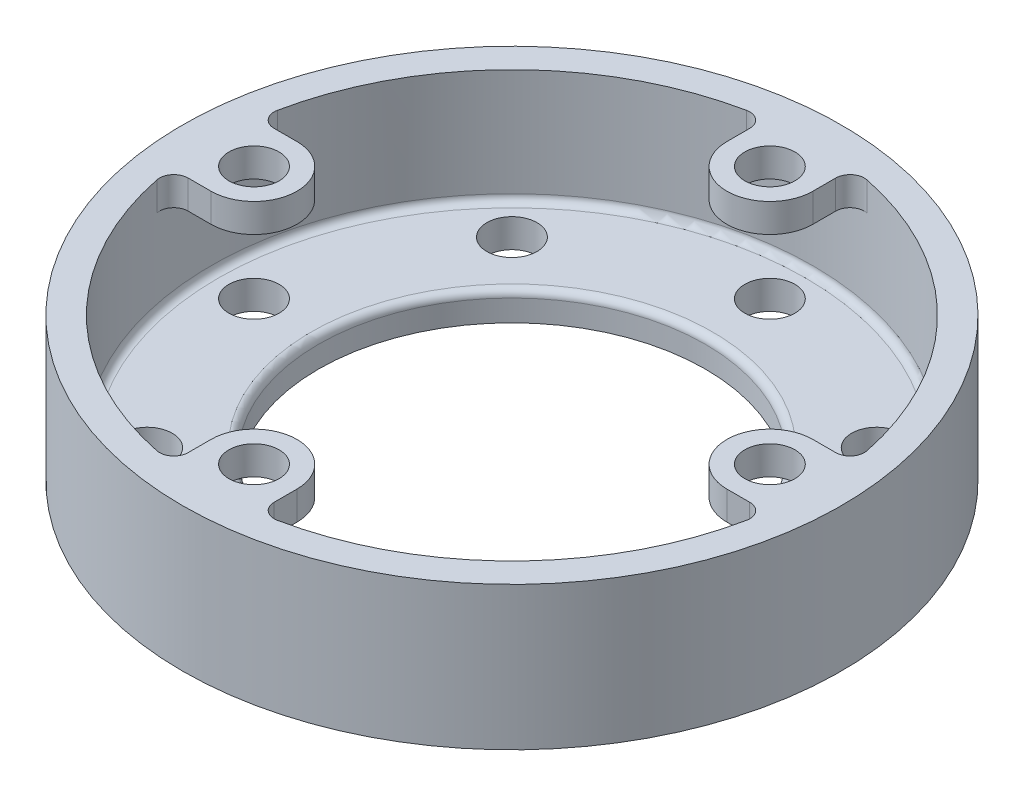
ISO-10303-21;
HEADER;
FILE_DESCRIPTION(('STEP AP214'),'2;1');
FILE_NAME('part.step','',(''),(''),'','','');
FILE_SCHEMA(('AUTOMOTIVE_DESIGN { 1 0 10303 214 1 1 1 1 }'));
ENDSEC;
DATA;
#1=APPLICATION_CONTEXT('core data for automotive mechanical design processes');
#2=APPLICATION_PROTOCOL_DEFINITION('international standard','automotive_design',2000,#1);
#3=PRODUCT_CONTEXT('',#1,'mechanical');
#4=PRODUCT('Part','Part','',(#3));
#5=PRODUCT_RELATED_PRODUCT_CATEGORY('part','',(#4));
#6=PRODUCT_DEFINITION_FORMATION('','',#4);
#7=PRODUCT_DEFINITION_CONTEXT('part definition',#1,'design');
#8=PRODUCT_DEFINITION('design','',#6,#7);
#9=PRODUCT_DEFINITION_SHAPE('','',#8);
#10=(LENGTH_UNIT() NAMED_UNIT(*) SI_UNIT(.MILLI.,.METRE.));
#11=(NAMED_UNIT(*) PLANE_ANGLE_UNIT() SI_UNIT($,.RADIAN.));
#12=(NAMED_UNIT(*) SI_UNIT($,.STERADIAN.) SOLID_ANGLE_UNIT());
#13=UNCERTAINTY_MEASURE_WITH_UNIT(LENGTH_MEASURE(1.E-05),#10,'distance_accuracy_value','');
#14=(GEOMETRIC_REPRESENTATION_CONTEXT(3) GLOBAL_UNCERTAINTY_ASSIGNED_CONTEXT((#13)) GLOBAL_UNIT_ASSIGNED_CONTEXT((#10,
#11,#12)) REPRESENTATION_CONTEXT('',''));
#15=CARTESIAN_POINT('',(0.,0.,0.));
#16=DIRECTION('',(0.,0.,1.));
#17=DIRECTION('',(1.,0.,0.));
#18=AXIS2_PLACEMENT_3D('',#15,#16,#17);
#19=CARTESIAN_POINT('',(0.,31.75,0.));
#20=DIRECTION('',(0.,-1.,0.));
#21=DIRECTION('',(0.,0.,-1.));
#22=AXIS2_PLACEMENT_3D('',#19,#20,#21);
#23=CYLINDRICAL_SURFACE('',#22,66.675);
#24=CARTESIAN_POINT('',(0.,7.9375,0.));
#25=DIRECTION('',(0.,1.,0.));
#26=DIRECTION('',(0.,0.,1.));
#27=AXIS2_PLACEMENT_3D('',#24,#25,#26);
#28=CIRCLE('',#27,66.675);
#29=CARTESIAN_POINT('',(0.,7.9375,66.675));
#30=VERTEX_POINT('',#29);
#31=EDGE_CURVE('E11',#30,#30,#28,.F.);
#32=ORIENTED_EDGE('',*,*,#31,.T.);
#33=EDGE_LOOP('',(#32));
#34=FACE_BOUND('',#33,.T.);
#35=CARTESIAN_POINT('',(0.,31.75,0.));
#36=DIRECTION('',(0.,1.,0.));
#37=DIRECTION('',(0.,0.,1.));
#38=AXIS2_PLACEMENT_3D('',#35,#36,#37);
#39=CIRCLE('',#38,66.675);
#40=CARTESIAN_POINT('',(13.334999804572,31.75,65.3278914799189));
#41=VERTEX_POINT('',#40);
#42=CARTESIAN_POINT('',(65.32789138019,31.75,13.335000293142));
#43=VERTEX_POINT('',#42);
#44=EDGE_CURVE('E619',#41,#43,#39,.T.);
#45=ORIENTED_EDGE('',*,*,#44,.T.);
#46=DIRECTION('',(0.,-1.,0.));
#47=VECTOR('',#46,1.);
#48=CARTESIAN_POINT('',(65.32789138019,31.75,13.335000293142));
#49=LINE('',#48,#47);
#50=CARTESIAN_POINT('',(65.32789138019,25.4,13.335000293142));
#51=VERTEX_POINT('',#50);
#52=EDGE_CURVE('E378',#43,#51,#49,.T.);
#53=ORIENTED_EDGE('',*,*,#52,.T.);
#54=CARTESIAN_POINT('',(0.,25.4,0.));
#55=DIRECTION('',(0.,1.,0.));
#56=DIRECTION('',(-1.,0.,-4.48724098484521E-09));
#57=AXIS2_PLACEMENT_3D('',#54,#55,#56);
#58=CIRCLE('',#57,66.675);
#59=CARTESIAN_POINT('',(65.3278914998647,25.4,-13.334999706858));
#60=VERTEX_POINT('',#59);
#61=EDGE_CURVE('E218',#51,#60,#58,.T.);
#62=ORIENTED_EDGE('',*,*,#61,.T.);
#63=DIRECTION('',(0.,-1.,0.));
#64=VECTOR('',#63,1.);
#65=CARTESIAN_POINT('',(65.3278914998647,31.75,-13.334999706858));
#66=LINE('',#65,#64);
#67=CARTESIAN_POINT('',(65.3278914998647,31.75,-13.334999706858));
#68=VERTEX_POINT('',#67);
#69=EDGE_CURVE('E375',#60,#68,#66,.F.);
#70=ORIENTED_EDGE('',*,*,#69,.T.);
#71=CARTESIAN_POINT('',(13.335,31.75,-65.3278914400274));
#72=VERTEX_POINT('',#71);
#73=EDGE_CURVE('E300',#68,#72,#39,.T.);
#74=ORIENTED_EDGE('',*,*,#73,.T.);
#75=DIRECTION('',(0.,-1.,0.));
#76=VECTOR('',#75,1.);
#77=CARTESIAN_POINT('',(13.335,31.75,-65.3278914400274));
#78=LINE('',#77,#76);
#79=CARTESIAN_POINT('',(13.335,25.4,-65.3278914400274));
#80=VERTEX_POINT('',#79);
#81=EDGE_CURVE('E317',#72,#80,#78,.T.);
#82=ORIENTED_EDGE('',*,*,#81,.T.);
#83=CARTESIAN_POINT('',(0.,25.4,0.));
#84=DIRECTION('',(0.,1.,0.));
#85=DIRECTION('',(0.,0.,1.));
#86=AXIS2_PLACEMENT_3D('',#83,#84,#85);
#87=CIRCLE('',#86,66.675);
#88=CARTESIAN_POINT('',(-13.335,25.4,-65.3278914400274));
#89=VERTEX_POINT('',#88);
#90=EDGE_CURVE('E282',#80,#89,#87,.T.);
#91=ORIENTED_EDGE('',*,*,#90,.T.);
#92=DIRECTION('',(0.,-1.,0.));
#93=VECTOR('',#92,1.);
#94=CARTESIAN_POINT('',(-13.335,31.75,-65.3278914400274));
#95=LINE('',#94,#93);
#96=CARTESIAN_POINT('',(-13.335,31.75,-65.3278914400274));
#97=VERTEX_POINT('',#96);
#98=EDGE_CURVE('E314',#89,#97,#95,.F.);
#99=ORIENTED_EDGE('',*,*,#98,.T.);
#100=CARTESIAN_POINT('',(-65.3278914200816,31.75,-13.335000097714));
#101=VERTEX_POINT('',#100);
#102=EDGE_CURVE('E301',#97,#101,#39,.T.);
#103=ORIENTED_EDGE('',*,*,#102,.T.);
#104=DIRECTION('',(0.,-1.,0.));
#105=VECTOR('',#104,1.);
#106=CARTESIAN_POINT('',(-65.3278914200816,31.75,-13.335000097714));
#107=LINE('',#106,#105);
#108=CARTESIAN_POINT('',(-65.3278914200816,25.4,-13.335000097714));
#109=VERTEX_POINT('',#108);
#110=EDGE_CURVE('E338',#101,#109,#107,.T.);
#111=ORIENTED_EDGE('',*,*,#110,.T.);
#112=CARTESIAN_POINT('',(0.,25.4,0.));
#113=DIRECTION('',(0.,1.,0.));
#114=DIRECTION('',(1.,0.,1.49574714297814E-09));
#115=AXIS2_PLACEMENT_3D('',#112,#113,#114);
#116=CIRCLE('',#115,66.675);
#117=CARTESIAN_POINT('',(-65.3278914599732,25.4,13.334999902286));
#118=VERTEX_POINT('',#117);
#119=EDGE_CURVE('E254',#109,#118,#116,.T.);
#120=ORIENTED_EDGE('',*,*,#119,.T.);
#121=DIRECTION('',(0.,-1.,0.));
#122=VECTOR('',#121,1.);
#123=CARTESIAN_POINT('',(-65.3278914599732,31.75,13.334999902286));
#124=LINE('',#123,#122);
#125=CARTESIAN_POINT('',(-65.3278914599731,31.75,13.334999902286));
#126=VERTEX_POINT('',#125);
#127=EDGE_CURVE('E335',#118,#126,#124,.F.);
#128=ORIENTED_EDGE('',*,*,#127,.T.);
#129=CARTESIAN_POINT('',(-13.335000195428,31.75,65.3278914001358));
#130=VERTEX_POINT('',#129);
#131=EDGE_CURVE('E305',#126,#130,#39,.T.);
#132=ORIENTED_EDGE('',*,*,#131,.T.);
#133=DIRECTION('',(0.,-1.,0.));
#134=VECTOR('',#133,1.);
#135=CARTESIAN_POINT('',(-13.335000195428,31.75,65.3278914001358));
#136=LINE('',#135,#134);
#137=CARTESIAN_POINT('',(-13.335000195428,25.4,65.3278914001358));
#138=VERTEX_POINT('',#137);
#139=EDGE_CURVE('E358',#130,#138,#136,.T.);
#140=ORIENTED_EDGE('',*,*,#139,.T.);
#141=CARTESIAN_POINT('',(0.,25.4,0.));
#142=DIRECTION('',(0.,1.,0.));
#143=DIRECTION('',(2.99149428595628E-09,0.,-1.));
#144=AXIS2_PLACEMENT_3D('',#141,#142,#143);
#145=CIRCLE('',#144,66.675);
#146=CARTESIAN_POINT('',(13.334999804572,25.4,65.3278914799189));
#147=VERTEX_POINT('',#146);
#148=EDGE_CURVE('E232',#138,#147,#145,.T.);
#149=ORIENTED_EDGE('',*,*,#148,.T.);
#150=DIRECTION('',(0.,-1.,0.));
#151=VECTOR('',#150,1.);
#152=CARTESIAN_POINT('',(13.334999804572,31.75,65.3278914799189));
#153=LINE('',#152,#151);
#154=EDGE_CURVE('E355',#147,#41,#153,.F.);
#155=ORIENTED_EDGE('',*,*,#154,.T.);
#156=EDGE_LOOP('',(#45,#53,#62,#70,#74,#82,#91,#99,#103,#111,#120,#128,#132,#140,#149,#155));
#157=FACE_BOUND('',#156,.T.);
#158=ADVANCED_FACE('F28',(#34,#157),#23,.F.);
#159=CARTESIAN_POINT('',(0.,31.75,0.));
#160=DIRECTION('',(0.,-1.,0.));
#161=DIRECTION('',(0.,0.,-1.));
#162=AXIS2_PLACEMENT_3D('',#159,#160,#161);
#163=CYLINDRICAL_SURFACE('',#162,73.025);
#164=CARTESIAN_POINT('',(0.,31.75,0.));
#165=DIRECTION('',(0.,1.,0.));
#166=DIRECTION('',(0.,0.,1.));
#167=AXIS2_PLACEMENT_3D('',#164,#165,#166);
#168=CIRCLE('',#167,73.025);
#169=CARTESIAN_POINT('',(0.,31.75,73.025));
#170=VERTEX_POINT('',#169);
#171=EDGE_CURVE('E308',#170,#170,#168,.T.);
#172=ORIENTED_EDGE('',*,*,#171,.F.);
#173=EDGE_LOOP('',(#172));
#174=FACE_BOUND('',#173,.T.);
#175=CARTESIAN_POINT('',(0.,0.,0.));
#176=DIRECTION('',(0.,1.,0.));
#177=DIRECTION('',(0.,0.,1.));
#178=AXIS2_PLACEMENT_3D('',#175,#176,#177);
#179=CIRCLE('',#178,73.025);
#180=CARTESIAN_POINT('',(0.,0.,73.025));
#181=VERTEX_POINT('',#180);
#182=EDGE_CURVE('E304',#181,#181,#179,.T.);
#183=ORIENTED_EDGE('',*,*,#182,.T.);
#184=EDGE_LOOP('',(#183));
#185=FACE_BOUND('',#184,.T.);
#186=ADVANCED_FACE('F30',(#174,#185),#163,.T.);
#187=CARTESIAN_POINT('',(0.,31.75,0.));
#188=DIRECTION('',(0.,1.,0.));
#189=DIRECTION('',(0.,0.,1.));
#190=AXIS2_PLACEMENT_3D('',#187,#188,#189);
#191=PLANE('',#190);
#192=CARTESIAN_POINT('',(57.15,31.75,2.56445822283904E-07));
#193=DIRECTION('',(0.,1.,0.));
#194=DIRECTION('',(-1.,0.,-4.48724098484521E-09));
#195=AXIS2_PLACEMENT_3D('',#192,#193,#194);
#196=CIRCLE('',#195,5.55625);
#197=CARTESIAN_POINT('',(51.59375,31.75,2.31513589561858E-07));
#198=VERTEX_POINT('',#197);
#199=EDGE_CURVE('E841',#198,#198,#196,.T.);
#200=ORIENTED_EDGE('',*,*,#199,.F.);
#201=EDGE_LOOP('',(#200));
#202=FACE_BOUND('',#201,.T.);
#203=CARTESIAN_POINT('',(-1.70963898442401E-07,31.75,57.15));
#204=DIRECTION('',(0.,1.,0.));
#205=DIRECTION('',(2.99149428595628E-09,0.,-1.));
#206=AXIS2_PLACEMENT_3D('',#203,#204,#205);
#207=CIRCLE('',#206,5.55625);
#208=CARTESIAN_POINT('',(-1.54342408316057E-07,31.75,51.59375));
#209=VERTEX_POINT('',#208);
#210=EDGE_CURVE('E832',#209,#209,#207,.T.);
#211=ORIENTED_EDGE('',*,*,#210,.F.);
#212=EDGE_LOOP('',(#211));
#213=FACE_BOUND('',#212,.T.);
#214=CARTESIAN_POINT('',(-57.15,31.75,-8.54819492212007E-08));
#215=DIRECTION('',(0.,1.,0.));
#216=DIRECTION('',(1.,0.,1.49574714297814E-09));
#217=AXIS2_PLACEMENT_3D('',#214,#215,#216);
#218=CIRCLE('',#217,5.55625);
#219=CARTESIAN_POINT('',(-51.59375,31.75,-7.71712041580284E-08));
#220=VERTEX_POINT('',#219);
#221=EDGE_CURVE('E213',#220,#220,#218,.T.);
#222=ORIENTED_EDGE('',*,*,#221,.F.);
#223=EDGE_LOOP('',(#222));
#224=FACE_BOUND('',#223,.T.);
#225=CARTESIAN_POINT('',(0.,31.75,-57.15));
#226=DIRECTION('',(0.,1.,0.));
#227=DIRECTION('',(0.,0.,1.));
#228=AXIS2_PLACEMENT_3D('',#225,#226,#227);
#229=CIRCLE('',#228,5.55625);
#230=CARTESIAN_POINT('',(0.,31.75,-51.59375));
#231=VERTEX_POINT('',#230);
#232=EDGE_CURVE('E267',#231,#231,#229,.T.);
#233=ORIENTED_EDGE('',*,*,#232,.F.);
#234=EDGE_LOOP('',(#233));
#235=FACE_BOUND('',#234,.T.);
#236=ORIENTED_EDGE('',*,*,#102,.F.);
#237=CARTESIAN_POINT('',(-12.7,31.75,-62.2170394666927));
#238=DIRECTION('',(0.,1.,0.));
#239=DIRECTION('',(0.,0.,1.));
#240=AXIS2_PLACEMENT_3D('',#237,#238,#239);
#241=CIRCLE('',#240,3.175);
#242=CARTESIAN_POINT('',(-9.525,31.75,-62.2170394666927));
#243=VERTEX_POINT('',#242);
#244=EDGE_CURVE('E327',#97,#243,#241,.F.);
#245=ORIENTED_EDGE('',*,*,#244,.T.);
#246=DIRECTION('',(0.,0.,-1.));
#247=VECTOR('',#246,1.);
#248=CARTESIAN_POINT('',(-9.525,31.75,-57.15));
#249=LINE('',#248,#247);
#250=CARTESIAN_POINT('',(-9.525,31.75,-57.15));
#251=VERTEX_POINT('',#250);
#252=EDGE_CURVE('E275',#251,#243,#249,.T.);
#253=ORIENTED_EDGE('',*,*,#252,.F.);
#254=CARTESIAN_POINT('',(0.,31.75,-57.15));
#255=DIRECTION('',(0.,-1.,0.));
#256=DIRECTION('',(0.,0.,-1.));
#257=AXIS2_PLACEMENT_3D('',#254,#255,#256);
#258=CIRCLE('',#257,9.525);
#259=CARTESIAN_POINT('',(9.525,31.75,-57.15));
#260=VERTEX_POINT('',#259);
#261=EDGE_CURVE('E278',#260,#251,#258,.T.);
#262=ORIENTED_EDGE('',*,*,#261,.F.);
#263=DIRECTION('',(0.,0.,1.));
#264=VECTOR('',#263,1.);
#265=CARTESIAN_POINT('',(9.525,31.75,-65.9911357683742));
#266=LINE('',#265,#264);
#267=CARTESIAN_POINT('',(9.525,31.75,-62.2170394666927));
#268=VERTEX_POINT('',#267);
#269=EDGE_CURVE('E280',#268,#260,#266,.T.);
#270=ORIENTED_EDGE('',*,*,#269,.F.);
#271=CARTESIAN_POINT('',(12.7,31.75,-62.2170394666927));
#272=DIRECTION('',(0.,1.,0.));
#273=DIRECTION('',(0.,0.,1.));
#274=AXIS2_PLACEMENT_3D('',#271,#272,#273);
#275=CIRCLE('',#274,3.175);
#276=EDGE_CURVE('E322',#268,#72,#275,.F.);
#277=ORIENTED_EDGE('',*,*,#276,.T.);
#278=ORIENTED_EDGE('',*,*,#73,.F.);
#279=CARTESIAN_POINT('',(62.2170395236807,31.75,-12.6999997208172));
#280=DIRECTION('',(0.,1.,0.));
#281=DIRECTION('',(0.,0.,1.));
#282=AXIS2_PLACEMENT_3D('',#279,#280,#281);
#283=CIRCLE('',#282,3.175);
#284=CARTESIAN_POINT('',(62.2170395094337,31.75,-9.52499972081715));
#285=VERTEX_POINT('',#284);
#286=EDGE_CURVE('E51',#68,#285,#283,.F.);
#287=ORIENTED_EDGE('',*,*,#286,.T.);
#288=DIRECTION('',(1.,0.,4.48724098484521E-09));
#289=VECTOR('',#288,1.);
#290=CARTESIAN_POINT('',(57.150000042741,31.75,-9.52499974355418));
#291=LINE('',#290,#289);
#292=CARTESIAN_POINT('',(57.150000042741,31.75,-9.52499974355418));
#293=VERTEX_POINT('',#292);
#294=EDGE_CURVE('E201',#293,#285,#291,.T.);
#295=ORIENTED_EDGE('',*,*,#294,.F.);
#296=CARTESIAN_POINT('',(57.15,31.75,2.56445822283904E-07));
#297=DIRECTION('',(0.,-1.,0.));
#298=DIRECTION('',(1.,0.,4.48724098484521E-09));
#299=AXIS2_PLACEMENT_3D('',#296,#297,#298);
#300=CIRCLE('',#299,9.525);
#301=CARTESIAN_POINT('',(57.149999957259,31.75,9.52500025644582));
#302=VERTEX_POINT('',#301);
#303=EDGE_CURVE('E192',#302,#293,#300,.T.);
#304=ORIENTED_EDGE('',*,*,#303,.F.);
#305=DIRECTION('',(-1.,0.,-4.48724098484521E-09));
#306=VECTOR('',#305,1.);
#307=CARTESIAN_POINT('',(65.9911357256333,31.75,9.52500029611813));
#308=LINE('',#307,#306);
#309=CARTESIAN_POINT('',(62.2170394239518,31.75,9.52500027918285));
#310=VERTEX_POINT('',#309);
#311=EDGE_CURVE('E200',#310,#302,#308,.T.);
#312=ORIENTED_EDGE('',*,*,#311,.F.);
#313=CARTESIAN_POINT('',(62.2170394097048,31.75,12.7000002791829));
#314=DIRECTION('',(0.,1.,0.));
#315=DIRECTION('',(0.,0.,1.));
#316=AXIS2_PLACEMENT_3D('',#313,#314,#315);
#317=CIRCLE('',#316,3.175);
#318=EDGE_CURVE('E382',#310,#43,#317,.F.);
#319=ORIENTED_EDGE('',*,*,#318,.T.);
#320=ORIENTED_EDGE('',*,*,#44,.F.);
#321=CARTESIAN_POINT('',(12.6999998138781,31.75,62.2170395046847));
#322=DIRECTION('',(0.,1.,0.));
#323=DIRECTION('',(0.,0.,1.));
#324=AXIS2_PLACEMENT_3D('',#321,#322,#323);
#325=CIRCLE('',#324,3.175);
#326=CARTESIAN_POINT('',(9.52499981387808,31.75,62.2170394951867));
#327=VERTEX_POINT('',#326);
#328=EDGE_CURVE('E367',#41,#327,#325,.F.);
#329=ORIENTED_EDGE('',*,*,#328,.T.);
#330=DIRECTION('',(-2.99149428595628E-09,0.,1.));
#331=VECTOR('',#330,1.);
#332=CARTESIAN_POINT('',(9.5249998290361,31.75,57.150000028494));
#333=LINE('',#332,#331);
#334=CARTESIAN_POINT('',(9.5249998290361,31.75,57.150000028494));
#335=VERTEX_POINT('',#334);
#336=EDGE_CURVE('E224',#335,#327,#333,.T.);
#337=ORIENTED_EDGE('',*,*,#336,.F.);
#338=CARTESIAN_POINT('',(-1.70963898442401E-07,31.75,57.15));
#339=DIRECTION('',(0.,-1.,0.));
#340=DIRECTION('',(-2.99149428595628E-09,0.,1.));
#341=AXIS2_PLACEMENT_3D('',#338,#339,#340);
#342=CIRCLE('',#341,9.525);
#343=CARTESIAN_POINT('',(-9.5250001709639,31.75,57.149999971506));
#344=VERTEX_POINT('',#343);
#345=EDGE_CURVE('E228',#344,#335,#342,.T.);
#346=ORIENTED_EDGE('',*,*,#345,.F.);
#347=DIRECTION('',(2.99149428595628E-09,0.,-1.));
#348=VECTOR('',#347,1.);
#349=CARTESIAN_POINT('',(-9.52500019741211,31.75,65.9911357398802));
#350=LINE('',#349,#348);
#351=CARTESIAN_POINT('',(-9.52500018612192,31.75,62.2170394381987));
#352=VERTEX_POINT('',#351);
#353=EDGE_CURVE('E230',#352,#344,#350,.T.);
#354=ORIENTED_EDGE('',*,*,#353,.F.);
#355=CARTESIAN_POINT('',(-12.7000001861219,31.75,62.2170394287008));
#356=DIRECTION('',(0.,1.,0.));
#357=DIRECTION('',(0.,0.,1.));
#358=AXIS2_PLACEMENT_3D('',#355,#356,#357);
#359=CIRCLE('',#358,3.175);
#360=EDGE_CURVE('E363',#352,#130,#359,.F.);
#361=ORIENTED_EDGE('',*,*,#360,.T.);
#362=ORIENTED_EDGE('',*,*,#131,.F.);
#363=CARTESIAN_POINT('',(-62.2170394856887,31.75,12.699999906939));
#364=DIRECTION('',(0.,1.,0.));
#365=DIRECTION('',(0.,0.,1.));
#366=AXIS2_PLACEMENT_3D('',#363,#364,#365);
#367=CIRCLE('',#366,3.175);
#368=CARTESIAN_POINT('',(-62.2170394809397,31.75,9.52499990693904));
#369=VERTEX_POINT('',#368);
#370=EDGE_CURVE('E347',#126,#369,#367,.F.);
#371=ORIENTED_EDGE('',*,*,#370,.T.);
#372=DIRECTION('',(-1.,0.,-1.49574714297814E-09));
#373=VECTOR('',#372,1.);
#374=CARTESIAN_POINT('',(-57.150000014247,31.75,9.52499991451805));
#375=LINE('',#374,#373);
#376=CARTESIAN_POINT('',(-57.150000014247,31.75,9.52499991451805));
#377=VERTEX_POINT('',#376);
#378=EDGE_CURVE('E245',#377,#369,#375,.T.);
#379=ORIENTED_EDGE('',*,*,#378,.F.);
#380=CARTESIAN_POINT('',(-57.15,31.75,-8.54819492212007E-08));
#381=DIRECTION('',(0.,-1.,0.));
#382=DIRECTION('',(-1.,0.,-1.49574714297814E-09));
#383=AXIS2_PLACEMENT_3D('',#380,#381,#382);
#384=CIRCLE('',#383,9.525);
#385=CARTESIAN_POINT('',(-57.149999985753,31.75,-9.52500008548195));
#386=VERTEX_POINT('',#385);
#387=EDGE_CURVE('E250',#386,#377,#384,.T.);
#388=ORIENTED_EDGE('',*,*,#387,.F.);
#389=DIRECTION('',(1.,0.,1.49574714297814E-09));
#390=VECTOR('',#389,1.);
#391=CARTESIAN_POINT('',(-65.9911357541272,31.75,-9.52500009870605));
#392=LINE('',#391,#390);
#393=CARTESIAN_POINT('',(-62.2170394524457,31.75,-9.52500009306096));
#394=VERTEX_POINT('',#393);
#395=EDGE_CURVE('E252',#394,#386,#392,.T.);
#396=ORIENTED_EDGE('',*,*,#395,.F.);
#397=CARTESIAN_POINT('',(-62.2170394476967,31.75,-12.700000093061));
#398=DIRECTION('',(0.,1.,0.));
#399=DIRECTION('',(0.,0.,1.));
#400=AXIS2_PLACEMENT_3D('',#397,#398,#399);
#401=CIRCLE('',#400,3.175);
#402=EDGE_CURVE('E343',#394,#101,#401,.F.);
#403=ORIENTED_EDGE('',*,*,#402,.T.);
#404=EDGE_LOOP('',(#236,#245,#253,#262,#270,#277,#278,#287,#295,#304,#312,#319,#320,#329,#337,
#346,#354,#361,#362,#371,#379,#388,#396,#403));
#405=FACE_BOUND('',#404,.T.);
#406=ORIENTED_EDGE('',*,*,#171,.T.);
#407=EDGE_LOOP('',(#406));
#408=FACE_BOUND('',#407,.T.);
#409=ADVANCED_FACE('F208',(#202,#213,#224,#235,#405,#408),#191,.T.);
#410=CARTESIAN_POINT('',(0.,0.,0.));
#411=DIRECTION('',(0.,1.,0.));
#412=DIRECTION('',(0.,0.,1.));
#413=AXIS2_PLACEMENT_3D('',#410,#411,#412);
#414=PLANE('',#413);
#415=CARTESIAN_POINT('',(-40.4111525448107,0.,-40.4111525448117));
#416=DIRECTION('',(0.,1.,0.));
#417=DIRECTION('',(0.707106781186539,0.,0.707106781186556));
#418=AXIS2_PLACEMENT_3D('',#415,#416,#417);
#419=CIRCLE('',#418,5.55625);
#420=CARTESIAN_POINT('',(-36.482290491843,0.,-36.4822904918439));
#421=VERTEX_POINT('',#420);
#422=EDGE_CURVE('E886',#421,#421,#419,.T.);
#423=ORIENTED_EDGE('',*,*,#422,.T.);
#424=EDGE_LOOP('',(#423));
#425=FACE_BOUND('',#424,.T.);
#426=CARTESIAN_POINT('',(-57.15,0.,-5.98614822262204E-13));
#427=DIRECTION('',(0.,1.,0.));
#428=DIRECTION('',(1.,0.,0.));
#429=AXIS2_PLACEMENT_3D('',#426,#427,#428);
#430=CIRCLE('',#429,5.55625);
#431=CARTESIAN_POINT('',(-51.59375,0.,-5.40416158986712E-13));
#432=VERTEX_POINT('',#431);
#433=EDGE_CURVE('E880',#432,#432,#430,.T.);
#434=ORIENTED_EDGE('',*,*,#433,.T.);
#435=EDGE_LOOP('',(#434));
#436=FACE_BOUND('',#435,.T.);
#437=CARTESIAN_POINT('',(-40.4111525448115,0.,40.4111525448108));
#438=DIRECTION('',(0.,1.,0.));
#439=DIRECTION('',(0.707106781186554,0.,-0.707106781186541));
#440=AXIS2_PLACEMENT_3D('',#437,#438,#439);
#441=CIRCLE('',#440,5.55625);
#442=CARTESIAN_POINT('',(-40.4111525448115,0.,45.9674025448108));
#443=VERTEX_POINT('',#442);
#444=EDGE_CURVE('E874',#443,#443,#441,.T.);
#445=ORIENTED_EDGE('',*,*,#444,.T.);
#446=EDGE_LOOP('',(#445));
#447=FACE_BOUND('',#446,.T.);
#448=CARTESIAN_POINT('',(-3.99076548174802E-13,0.,57.15));
#449=DIRECTION('',(0.,1.,0.));
#450=DIRECTION('',(0.,0.,-1.));
#451=AXIS2_PLACEMENT_3D('',#448,#449,#450);
#452=CIRCLE('',#451,5.55625);
#453=CARTESIAN_POINT('',(-3.60277439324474E-13,0.,51.59375));
#454=VERTEX_POINT('',#453);
#455=EDGE_CURVE('E868',#454,#454,#452,.T.);
#456=ORIENTED_EDGE('',*,*,#455,.T.);
#457=EDGE_LOOP('',(#456));
#458=FACE_BOUND('',#457,.T.);
#459=CARTESIAN_POINT('',(40.411152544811,0.,40.4111525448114));
#460=DIRECTION('',(0.,1.,0.));
#461=DIRECTION('',(-0.707106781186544,0.,-0.707106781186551));
#462=AXIS2_PLACEMENT_3D('',#459,#460,#461);
#463=CIRCLE('',#462,5.55625);
#464=CARTESIAN_POINT('',(36.4822904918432,0.,36.4822904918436));
#465=VERTEX_POINT('',#464);
#466=EDGE_CURVE('E862',#465,#465,#463,.T.);
#467=ORIENTED_EDGE('',*,*,#466,.T.);
#468=EDGE_LOOP('',(#467));
#469=FACE_BOUND('',#468,.T.);
#470=CARTESIAN_POINT('',(57.15,0.,1.99538274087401E-13));
#471=DIRECTION('',(0.,1.,0.));
#472=DIRECTION('',(-1.,0.,0.));
#473=AXIS2_PLACEMENT_3D('',#470,#471,#472);
#474=CIRCLE('',#473,5.55625);
#475=CARTESIAN_POINT('',(51.59375,0.,1.80138719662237E-13));
#476=VERTEX_POINT('',#475);
#477=EDGE_CURVE('E856',#476,#476,#474,.T.);
#478=ORIENTED_EDGE('',*,*,#477,.T.);
#479=EDGE_LOOP('',(#478));
#480=FACE_BOUND('',#479,.T.);
#481=CARTESIAN_POINT('',(40.4111525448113,0.,-40.4111525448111));
#482=DIRECTION('',(0.,1.,0.));
#483=DIRECTION('',(-0.707106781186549,0.,0.707106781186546));
#484=AXIS2_PLACEMENT_3D('',#481,#482,#483);
#485=CIRCLE('',#484,5.55625);
#486=CARTESIAN_POINT('',(36.4822904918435,0.,-36.4822904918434));
#487=VERTEX_POINT('',#486);
#488=EDGE_CURVE('E850',#487,#487,#485,.T.);
#489=ORIENTED_EDGE('',*,*,#488,.T.);
#490=EDGE_LOOP('',(#489));
#491=FACE_BOUND('',#490,.T.);
#492=CARTESIAN_POINT('',(0.,0.,-57.15));
#493=DIRECTION('',(0.,1.,0.));
#494=DIRECTION('',(0.,0.,1.));
#495=AXIS2_PLACEMENT_3D('',#492,#493,#494);
#496=CIRCLE('',#495,5.55625);
#497=CARTESIAN_POINT('',(0.,0.,-51.59375));
#498=VERTEX_POINT('',#497);
#499=EDGE_CURVE('E844',#498,#498,#496,.T.);
#500=ORIENTED_EDGE('',*,*,#499,.T.);
#501=EDGE_LOOP('',(#500));
#502=FACE_BOUND('',#501,.T.);
#503=CARTESIAN_POINT('',(0.,0.,0.));
#504=DIRECTION('',(0.,1.,0.));
#505=DIRECTION('',(0.,0.,1.));
#506=AXIS2_PLACEMENT_3D('',#503,#504,#505);
#507=CIRCLE('',#506,42.8625);
#508=CARTESIAN_POINT('',(0.,0.,42.8625));
#509=VERTEX_POINT('',#508);
#510=EDGE_CURVE('E295',#509,#509,#507,.T.);
#511=ORIENTED_EDGE('',*,*,#510,.T.);
#512=EDGE_LOOP('',(#511));
#513=FACE_BOUND('',#512,.T.);
#514=ORIENTED_EDGE('',*,*,#182,.F.);
#515=EDGE_LOOP('',(#514));
#516=FACE_BOUND('',#515,.T.);
#517=ADVANCED_FACE('F416',(#425,#436,#447,#458,#469,#480,#491,#502,#513,#516),#414,.F.);
#518=CARTESIAN_POINT('',(0.,6.35,0.));
#519=DIRECTION('',(0.,1.,0.));
#520=DIRECTION('',(0.,0.,1.));
#521=AXIS2_PLACEMENT_3D('',#518,#519,#520);
#522=PLANE('',#521);
#523=CARTESIAN_POINT('',(0.,6.35,0.));
#524=DIRECTION('',(0.,1.,0.));
#525=DIRECTION('',(0.,0.,1.));
#526=AXIS2_PLACEMENT_3D('',#523,#524,#525);
#527=CIRCLE('',#526,44.45);
#528=CARTESIAN_POINT('',(0.,6.35,44.45));
#529=VERTEX_POINT('',#528);
#530=EDGE_CURVE('E36',#529,#529,#527,.F.);
#531=ORIENTED_EDGE('',*,*,#530,.T.);
#532=EDGE_LOOP('',(#531));
#533=FACE_BOUND('',#532,.T.);
#534=CARTESIAN_POINT('',(0.,6.35,0.));
#535=DIRECTION('',(0.,1.,0.));
#536=DIRECTION('',(0.,0.,1.));
#537=AXIS2_PLACEMENT_3D('',#534,#535,#536);
#538=CIRCLE('',#537,65.0875);
#539=CARTESIAN_POINT('',(0.,6.35,65.0875));
#540=VERTEX_POINT('',#539);
#541=EDGE_CURVE('E393',#540,#540,#538,.T.);
#542=ORIENTED_EDGE('',*,*,#541,.T.);
#543=EDGE_LOOP('',(#542));
#544=FACE_BOUND('',#543,.T.);
#545=CARTESIAN_POINT('',(-40.4111525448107,6.35,-40.4111525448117));
#546=DIRECTION('',(0.,1.,0.));
#547=DIRECTION('',(0.707106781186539,0.,0.707106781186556));
#548=AXIS2_PLACEMENT_3D('',#545,#546,#547);
#549=CIRCLE('',#548,5.55625);
#550=CARTESIAN_POINT('',(-36.482290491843,6.35,-36.4822904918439));
#551=VERTEX_POINT('',#550);
#552=EDGE_CURVE('E889',#551,#551,#549,.T.);
#553=ORIENTED_EDGE('',*,*,#552,.F.);
#554=EDGE_LOOP('',(#553));
#555=FACE_BOUND('',#554,.T.);
#556=CARTESIAN_POINT('',(-57.15,6.35,-5.98614822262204E-13));
#557=DIRECTION('',(0.,1.,0.));
#558=DIRECTION('',(1.,0.,0.));
#559=AXIS2_PLACEMENT_3D('',#556,#557,#558);
#560=CIRCLE('',#559,5.55625);
#561=CARTESIAN_POINT('',(-51.59375,6.35,-5.40416158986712E-13));
#562=VERTEX_POINT('',#561);
#563=EDGE_CURVE('E883',#562,#562,#560,.T.);
#564=ORIENTED_EDGE('',*,*,#563,.F.);
#565=EDGE_LOOP('',(#564));
#566=FACE_BOUND('',#565,.T.);
#567=CARTESIAN_POINT('',(-40.4111525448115,6.35,40.4111525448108));
#568=DIRECTION('',(0.,1.,0.));
#569=DIRECTION('',(0.707106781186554,0.,-0.707106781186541));
#570=AXIS2_PLACEMENT_3D('',#567,#568,#569);
#571=CIRCLE('',#570,5.55625);
#572=CARTESIAN_POINT('',(-40.4111525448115,6.35,45.9674025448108));
#573=VERTEX_POINT('',#572);
#574=EDGE_CURVE('E877',#573,#573,#571,.T.);
#575=ORIENTED_EDGE('',*,*,#574,.F.);
#576=EDGE_LOOP('',(#575));
#577=FACE_BOUND('',#576,.T.);
#578=CARTESIAN_POINT('',(-3.99076548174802E-13,6.35,57.15));
#579=DIRECTION('',(0.,1.,0.));
#580=DIRECTION('',(0.,0.,-1.));
#581=AXIS2_PLACEMENT_3D('',#578,#579,#580);
#582=CIRCLE('',#581,5.55625);
#583=CARTESIAN_POINT('',(-3.60277439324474E-13,6.35,51.59375));
#584=VERTEX_POINT('',#583);
#585=EDGE_CURVE('E871',#584,#584,#582,.T.);
#586=ORIENTED_EDGE('',*,*,#585,.F.);
#587=EDGE_LOOP('',(#586));
#588=FACE_BOUND('',#587,.T.);
#589=CARTESIAN_POINT('',(40.411152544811,6.35,40.4111525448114));
#590=DIRECTION('',(0.,1.,0.));
#591=DIRECTION('',(-0.707106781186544,0.,-0.707106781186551));
#592=AXIS2_PLACEMENT_3D('',#589,#590,#591);
#593=CIRCLE('',#592,5.55625);
#594=CARTESIAN_POINT('',(36.4822904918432,6.35,36.4822904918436));
#595=VERTEX_POINT('',#594);
#596=EDGE_CURVE('E865',#595,#595,#593,.T.);
#597=ORIENTED_EDGE('',*,*,#596,.F.);
#598=EDGE_LOOP('',(#597));
#599=FACE_BOUND('',#598,.T.);
#600=CARTESIAN_POINT('',(57.15,6.35,1.99538274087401E-13));
#601=DIRECTION('',(0.,1.,0.));
#602=DIRECTION('',(-1.,0.,0.));
#603=AXIS2_PLACEMENT_3D('',#600,#601,#602);
#604=CIRCLE('',#603,5.55625);
#605=CARTESIAN_POINT('',(51.59375,6.35,1.80138719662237E-13));
#606=VERTEX_POINT('',#605);
#607=EDGE_CURVE('E859',#606,#606,#604,.T.);
#608=ORIENTED_EDGE('',*,*,#607,.F.);
#609=EDGE_LOOP('',(#608));
#610=FACE_BOUND('',#609,.T.);
#611=CARTESIAN_POINT('',(40.4111525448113,6.35,-40.4111525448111));
#612=DIRECTION('',(0.,1.,0.));
#613=DIRECTION('',(-0.707106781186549,0.,0.707106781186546));
#614=AXIS2_PLACEMENT_3D('',#611,#612,#613);
#615=CIRCLE('',#614,5.55625);
#616=CARTESIAN_POINT('',(36.4822904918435,6.35,-36.4822904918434));
#617=VERTEX_POINT('',#616);
#618=EDGE_CURVE('E853',#617,#617,#615,.T.);
#619=ORIENTED_EDGE('',*,*,#618,.F.);
#620=EDGE_LOOP('',(#619));
#621=FACE_BOUND('',#620,.T.);
#622=CARTESIAN_POINT('',(0.,6.35,-57.15));
#623=DIRECTION('',(0.,1.,0.));
#624=DIRECTION('',(0.,0.,1.));
#625=AXIS2_PLACEMENT_3D('',#622,#623,#624);
#626=CIRCLE('',#625,5.55625);
#627=CARTESIAN_POINT('',(0.,6.35,-51.59375));
#628=VERTEX_POINT('',#627);
#629=EDGE_CURVE('E847',#628,#628,#626,.T.);
#630=ORIENTED_EDGE('',*,*,#629,.F.);
#631=EDGE_LOOP('',(#630));
#632=FACE_BOUND('',#631,.T.);
#633=ADVANCED_FACE('F398',(#533,#544,#555,#566,#577,#588,#599,#610,#621,#632),#522,.T.);
#634=CARTESIAN_POINT('',(0.,0.,0.));
#635=DIRECTION('',(0.,1.,0.));
#636=DIRECTION('',(0.,0.,1.));
#637=AXIS2_PLACEMENT_3D('',#634,#635,#636);
#638=CYLINDRICAL_SURFACE('',#637,42.8625);
#639=CARTESIAN_POINT('',(0.,4.7625,0.));
#640=DIRECTION('',(0.,1.,0.));
#641=DIRECTION('',(0.,0.,1.));
#642=AXIS2_PLACEMENT_3D('',#639,#640,#641);
#643=CIRCLE('',#642,42.8625);
#644=CARTESIAN_POINT('',(0.,4.7625,42.8625));
#645=VERTEX_POINT('',#644);
#646=EDGE_CURVE('E390',#645,#645,#643,.T.);
#647=ORIENTED_EDGE('',*,*,#646,.T.);
#648=EDGE_LOOP('',(#647));
#649=FACE_BOUND('',#648,.T.);
#650=ORIENTED_EDGE('',*,*,#510,.F.);
#651=EDGE_LOOP('',(#650));
#652=FACE_BOUND('',#651,.T.);
#653=ADVANCED_FACE('F409',(#649,#652),#638,.F.);
#654=CARTESIAN_POINT('',(9.525,25.4,-65.9911357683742));
#655=DIRECTION('',(-1.,0.,0.));
#656=DIRECTION('',(0.,0.,1.));
#657=AXIS2_PLACEMENT_3D('',#654,#655,#656);
#658=PLANE('',#657);
#659=DIRECTION('',(0.,0.,1.));
#660=VECTOR('',#659,1.);
#661=CARTESIAN_POINT('',(9.525,25.4,-65.9911357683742));
#662=LINE('',#661,#660);
#663=CARTESIAN_POINT('',(9.525,25.4,-62.2170394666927));
#664=VERTEX_POINT('',#663);
#665=CARTESIAN_POINT('',(9.525,25.4,-57.15));
#666=VERTEX_POINT('',#665);
#667=EDGE_CURVE('E289',#664,#666,#662,.T.);
#668=ORIENTED_EDGE('',*,*,#667,.F.);
#669=DIRECTION('',(0.,-1.,0.));
#670=VECTOR('',#669,1.);
#671=CARTESIAN_POINT('',(9.525,25.4,-62.2170394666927));
#672=LINE('',#671,#670);
#673=EDGE_CURVE('E311',#664,#268,#672,.F.);
#674=ORIENTED_EDGE('',*,*,#673,.T.);
#675=ORIENTED_EDGE('',*,*,#269,.T.);
#676=DIRECTION('',(0.,1.,0.));
#677=VECTOR('',#676,1.);
#678=CARTESIAN_POINT('',(9.525,25.4,-57.15));
#679=LINE('',#678,#677);
#680=EDGE_CURVE('E292',#666,#260,#679,.T.);
#681=ORIENTED_EDGE('',*,*,#680,.F.);
#682=EDGE_LOOP('',(#668,#674,#675,#681));
#683=FACE_BOUND('',#682,.T.);
#684=ADVANCED_FACE('F412',(#683),#658,.F.);
#685=CARTESIAN_POINT('',(0.,25.4,-57.15));
#686=DIRECTION('',(0.,1.,0.));
#687=DIRECTION('',(0.,0.,1.));
#688=AXIS2_PLACEMENT_3D('',#685,#686,#687);
#689=CYLINDRICAL_SURFACE('',#688,9.525);
#690=ORIENTED_EDGE('',*,*,#261,.T.);
#691=DIRECTION('',(0.,1.,0.));
#692=VECTOR('',#691,1.);
#693=CARTESIAN_POINT('',(-9.525,25.4,-57.15));
#694=LINE('',#693,#692);
#695=CARTESIAN_POINT('',(-9.525,25.4,-57.15));
#696=VERTEX_POINT('',#695);
#697=EDGE_CURVE('E291',#696,#251,#694,.T.);
#698=ORIENTED_EDGE('',*,*,#697,.F.);
#699=CARTESIAN_POINT('',(0.,25.4,-57.15));
#700=DIRECTION('',(0.,-1.,0.));
#701=DIRECTION('',(0.,0.,-1.));
#702=AXIS2_PLACEMENT_3D('',#699,#700,#701);
#703=CIRCLE('',#702,9.525);
#704=EDGE_CURVE('E287',#666,#696,#703,.T.);
#705=ORIENTED_EDGE('',*,*,#704,.F.);
#706=ORIENTED_EDGE('',*,*,#680,.T.);
#707=EDGE_LOOP('',(#690,#698,#705,#706));
#708=FACE_BOUND('',#707,.T.);
#709=ADVANCED_FACE('F595',(#708),#689,.T.);
#710=CARTESIAN_POINT('',(-9.525,25.4,-57.15));
#711=DIRECTION('',(1.,0.,0.));
#712=DIRECTION('',(0.,0.,-1.));
#713=AXIS2_PLACEMENT_3D('',#710,#711,#712);
#714=PLANE('',#713);
#715=ORIENTED_EDGE('',*,*,#252,.T.);
#716=DIRECTION('',(0.,-1.,0.));
#717=VECTOR('',#716,1.);
#718=CARTESIAN_POINT('',(-9.525,25.4,-62.2170394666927));
#719=LINE('',#718,#717);
#720=CARTESIAN_POINT('',(-9.525,25.4,-62.2170394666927));
#721=VERTEX_POINT('',#720);
#722=EDGE_CURVE('E320',#243,#721,#719,.T.);
#723=ORIENTED_EDGE('',*,*,#722,.T.);
#724=DIRECTION('',(0.,0.,-1.));
#725=VECTOR('',#724,1.);
#726=CARTESIAN_POINT('',(-9.525,25.4,-57.15));
#727=LINE('',#726,#725);
#728=EDGE_CURVE('E284',#696,#721,#727,.T.);
#729=ORIENTED_EDGE('',*,*,#728,.F.);
#730=ORIENTED_EDGE('',*,*,#697,.T.);
#731=EDGE_LOOP('',(#715,#723,#729,#730));
#732=FACE_BOUND('',#731,.T.);
#733=ADVANCED_FACE('F591',(#732),#714,.F.);
#734=CARTESIAN_POINT('',(0.,25.4,0.));
#735=DIRECTION('',(0.,1.,0.));
#736=DIRECTION('',(0.,0.,1.));
#737=AXIS2_PLACEMENT_3D('',#734,#735,#736);
#738=PLANE('',#737);
#739=CARTESIAN_POINT('',(0.,25.4,-57.15));
#740=DIRECTION('',(0.,1.,0.));
#741=DIRECTION('',(0.,0.,1.));
#742=AXIS2_PLACEMENT_3D('',#739,#740,#741);
#743=CIRCLE('',#742,5.55625);
#744=CARTESIAN_POINT('',(0.,25.4,-51.59375));
#745=VERTEX_POINT('',#744);
#746=EDGE_CURVE('E272',#745,#745,#743,.F.);
#747=ORIENTED_EDGE('',*,*,#746,.F.);
#748=EDGE_LOOP('',(#747));
#749=FACE_BOUND('',#748,.T.);
#750=ORIENTED_EDGE('',*,*,#90,.F.);
#751=CARTESIAN_POINT('',(12.7,25.4,-62.2170394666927));
#752=DIRECTION('',(0.,1.,0.));
#753=DIRECTION('',(0.,0.,1.));
#754=AXIS2_PLACEMENT_3D('',#751,#752,#753);
#755=CIRCLE('',#754,3.175);
#756=EDGE_CURVE('E325',#80,#664,#755,.T.);
#757=ORIENTED_EDGE('',*,*,#756,.T.);
#758=ORIENTED_EDGE('',*,*,#667,.T.);
#759=ORIENTED_EDGE('',*,*,#704,.T.);
#760=ORIENTED_EDGE('',*,*,#728,.T.);
#761=CARTESIAN_POINT('',(-12.7,25.4,-62.2170394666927));
#762=DIRECTION('',(0.,1.,0.));
#763=DIRECTION('',(0.,0.,1.));
#764=AXIS2_PLACEMENT_3D('',#761,#762,#763);
#765=CIRCLE('',#764,3.175);
#766=EDGE_CURVE('E329',#721,#89,#765,.T.);
#767=ORIENTED_EDGE('',*,*,#766,.T.);
#768=EDGE_LOOP('',(#750,#757,#758,#759,#760,#767));
#769=FACE_BOUND('',#768,.T.);
#770=ADVANCED_FACE('F587',(#749,#769),#738,.F.);
#771=CARTESIAN_POINT('',(0.,-0.001000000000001,-57.15));
#772=DIRECTION('',(0.,1.,0.));
#773=DIRECTION('',(0.,0.,1.));
#774=AXIS2_PLACEMENT_3D('',#771,#772,#773);
#775=CYLINDRICAL_SURFACE('',#774,5.55625);
#776=ORIENTED_EDGE('',*,*,#232,.T.);
#777=EDGE_LOOP('',(#776));
#778=FACE_BOUND('',#777,.T.);
#779=ORIENTED_EDGE('',*,*,#746,.T.);
#780=EDGE_LOOP('',(#779));
#781=FACE_BOUND('',#780,.T.);
#782=ADVANCED_FACE('F583',(#778,#781),#775,.F.);
#783=CARTESIAN_POINT('',(12.7,31.75,-62.2170394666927));
#784=DIRECTION('',(0.,-1.,0.));
#785=DIRECTION('',(0.,0.,-1.));
#786=AXIS2_PLACEMENT_3D('',#783,#784,#785);
#787=CYLINDRICAL_SURFACE('',#786,3.175);
#788=ORIENTED_EDGE('',*,*,#756,.F.);
#789=ORIENTED_EDGE('',*,*,#81,.F.);
#790=ORIENTED_EDGE('',*,*,#276,.F.);
#791=ORIENTED_EDGE('',*,*,#673,.F.);
#792=EDGE_LOOP('',(#788,#789,#790,#791));
#793=FACE_BOUND('',#792,.T.);
#794=ADVANCED_FACE('F579',(#793),#787,.F.);
#795=CARTESIAN_POINT('',(-12.7,31.75,-62.2170394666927));
#796=DIRECTION('',(0.,-1.,0.));
#797=DIRECTION('',(0.,0.,-1.));
#798=AXIS2_PLACEMENT_3D('',#795,#796,#797);
#799=CYLINDRICAL_SURFACE('',#798,3.175);
#800=ORIENTED_EDGE('',*,*,#766,.F.);
#801=ORIENTED_EDGE('',*,*,#722,.F.);
#802=ORIENTED_EDGE('',*,*,#244,.F.);
#803=ORIENTED_EDGE('',*,*,#98,.F.);
#804=EDGE_LOOP('',(#800,#801,#802,#803));
#805=FACE_BOUND('',#804,.T.);
#806=ADVANCED_FACE('F569',(#805),#799,.F.);
#807=CARTESIAN_POINT('',(-65.9911357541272,25.4,-9.52500009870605));
#808=DIRECTION('',(-1.49574714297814E-09,0.,1.));
#809=DIRECTION('',(1.,0.,1.49574714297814E-09));
#810=AXIS2_PLACEMENT_3D('',#807,#808,#809);
#811=PLANE('',#810);
#812=DIRECTION('',(1.,0.,1.49574714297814E-09));
#813=VECTOR('',#812,1.);
#814=CARTESIAN_POINT('',(-65.9911357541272,25.4,-9.52500009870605));
#815=LINE('',#814,#813);
#816=CARTESIAN_POINT('',(-62.2170394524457,25.4,-9.52500009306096));
#817=VERTEX_POINT('',#816);
#818=CARTESIAN_POINT('',(-57.149999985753,25.4,-9.52500008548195));
#819=VERTEX_POINT('',#818);
#820=EDGE_CURVE('E261',#817,#819,#815,.T.);
#821=ORIENTED_EDGE('',*,*,#820,.F.);
#822=DIRECTION('',(0.,-1.,0.));
#823=VECTOR('',#822,1.);
#824=CARTESIAN_POINT('',(-62.2170394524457,25.4,-9.52500009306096));
#825=LINE('',#824,#823);
#826=EDGE_CURVE('E332',#817,#394,#825,.F.);
#827=ORIENTED_EDGE('',*,*,#826,.T.);
#828=ORIENTED_EDGE('',*,*,#395,.T.);
#829=DIRECTION('',(0.,1.,0.));
#830=VECTOR('',#829,1.);
#831=CARTESIAN_POINT('',(-57.149999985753,25.4,-9.52500008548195));
#832=LINE('',#831,#830);
#833=EDGE_CURVE('E264',#819,#386,#832,.T.);
#834=ORIENTED_EDGE('',*,*,#833,.F.);
#835=EDGE_LOOP('',(#821,#827,#828,#834));
#836=FACE_BOUND('',#835,.T.);
#837=ADVANCED_FACE('F565',(#836),#811,.F.);
#838=CARTESIAN_POINT('',(-57.15,25.4,-8.54819492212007E-08));
#839=DIRECTION('',(0.,1.,0.));
#840=DIRECTION('',(0.,0.,1.));
#841=AXIS2_PLACEMENT_3D('',#838,#839,#840);
#842=CYLINDRICAL_SURFACE('',#841,9.525);
#843=ORIENTED_EDGE('',*,*,#387,.T.);
#844=DIRECTION('',(0.,1.,0.));
#845=VECTOR('',#844,1.);
#846=CARTESIAN_POINT('',(-57.150000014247,25.4,9.52499991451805));
#847=LINE('',#846,#845);
#848=CARTESIAN_POINT('',(-57.150000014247,25.4,9.52499991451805));
#849=VERTEX_POINT('',#848);
#850=EDGE_CURVE('E263',#849,#377,#847,.T.);
#851=ORIENTED_EDGE('',*,*,#850,.F.);
#852=CARTESIAN_POINT('',(-57.15,25.4,-8.54819492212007E-08));
#853=DIRECTION('',(0.,-1.,0.));
#854=DIRECTION('',(-1.,0.,-1.49574714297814E-09));
#855=AXIS2_PLACEMENT_3D('',#852,#853,#854);
#856=CIRCLE('',#855,9.525);
#857=EDGE_CURVE('E259',#819,#849,#856,.T.);
#858=ORIENTED_EDGE('',*,*,#857,.F.);
#859=ORIENTED_EDGE('',*,*,#833,.T.);
#860=EDGE_LOOP('',(#843,#851,#858,#859));
#861=FACE_BOUND('',#860,.T.);
#862=ADVANCED_FACE('F568',(#861),#842,.T.);
#863=CARTESIAN_POINT('',(-57.150000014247,25.4,9.52499991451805));
#864=DIRECTION('',(1.49574714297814E-09,0.,-1.));
#865=DIRECTION('',(-1.,0.,-1.49574714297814E-09));
#866=AXIS2_PLACEMENT_3D('',#863,#864,#865);
#867=PLANE('',#866);
#868=ORIENTED_EDGE('',*,*,#378,.T.);
#869=DIRECTION('',(0.,-1.,0.));
#870=VECTOR('',#869,1.);
#871=CARTESIAN_POINT('',(-62.2170394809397,25.4,9.52499990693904));
#872=LINE('',#871,#870);
#873=CARTESIAN_POINT('',(-62.2170394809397,25.4,9.52499990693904));
#874=VERTEX_POINT('',#873);
#875=EDGE_CURVE('E341',#369,#874,#872,.T.);
#876=ORIENTED_EDGE('',*,*,#875,.T.);
#877=DIRECTION('',(-1.,0.,-1.49574714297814E-09));
#878=VECTOR('',#877,1.);
#879=CARTESIAN_POINT('',(-57.150000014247,25.4,9.52499991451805));
#880=LINE('',#879,#878);
#881=EDGE_CURVE('E256',#849,#874,#880,.T.);
#882=ORIENTED_EDGE('',*,*,#881,.F.);
#883=ORIENTED_EDGE('',*,*,#850,.T.);
#884=EDGE_LOOP('',(#868,#876,#882,#883));
#885=FACE_BOUND('',#884,.T.);
#886=ADVANCED_FACE('F563',(#885),#867,.F.);
#887=CARTESIAN_POINT('',(0.,25.4,0.));
#888=DIRECTION('',(0.,1.,0.));
#889=DIRECTION('',(1.,0.,1.49574714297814E-09));
#890=AXIS2_PLACEMENT_3D('',#887,#888,#889);
#891=PLANE('',#890);
#892=CARTESIAN_POINT('',(-57.15,25.4,-8.54819492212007E-08));
#893=DIRECTION('',(0.,1.,0.));
#894=DIRECTION('',(0.,0.,1.));
#895=AXIS2_PLACEMENT_3D('',#892,#893,#894);
#896=CIRCLE('',#895,5.55625);
#897=CARTESIAN_POINT('',(-57.15,25.4,5.55624991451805));
#898=VERTEX_POINT('',#897);
#899=EDGE_CURVE('E210',#898,#898,#896,.F.);
#900=ORIENTED_EDGE('',*,*,#899,.F.);
#901=EDGE_LOOP('',(#900));
#902=FACE_BOUND('',#901,.T.);
#903=ORIENTED_EDGE('',*,*,#119,.F.);
#904=CARTESIAN_POINT('',(-62.2170394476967,25.4,-12.700000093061));
#905=DIRECTION('',(0.,1.,0.));
#906=DIRECTION('',(0.,0.,1.));
#907=AXIS2_PLACEMENT_3D('',#904,#905,#906);
#908=CIRCLE('',#907,3.175);
#909=EDGE_CURVE('E345',#109,#817,#908,.T.);
#910=ORIENTED_EDGE('',*,*,#909,.T.);
#911=ORIENTED_EDGE('',*,*,#820,.T.);
#912=ORIENTED_EDGE('',*,*,#857,.T.);
#913=ORIENTED_EDGE('',*,*,#881,.T.);
#914=CARTESIAN_POINT('',(-62.2170394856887,25.4,12.699999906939));
#915=DIRECTION('',(0.,1.,0.));
#916=DIRECTION('',(0.,0.,1.));
#917=AXIS2_PLACEMENT_3D('',#914,#915,#916);
#918=CIRCLE('',#917,3.175);
#919=EDGE_CURVE('E349',#874,#118,#918,.T.);
#920=ORIENTED_EDGE('',*,*,#919,.T.);
#921=EDGE_LOOP('',(#903,#910,#911,#912,#913,#920));
#922=FACE_BOUND('',#921,.T.);
#923=ADVANCED_FACE('F553',(#902,#922),#891,.F.);
#924=CARTESIAN_POINT('',(-9.52500019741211,25.4,65.9911357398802));
#925=DIRECTION('',(1.,0.,2.99149428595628E-09));
#926=DIRECTION('',(2.99149428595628E-09,0.,-1.));
#927=AXIS2_PLACEMENT_3D('',#924,#925,#926);
#928=PLANE('',#927);
#929=DIRECTION('',(2.99149428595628E-09,0.,-1.));
#930=VECTOR('',#929,1.);
#931=CARTESIAN_POINT('',(-9.52500019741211,25.4,65.9911357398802));
#932=LINE('',#931,#930);
#933=CARTESIAN_POINT('',(-9.52500018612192,25.4,62.2170394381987));
#934=VERTEX_POINT('',#933);
#935=CARTESIAN_POINT('',(-9.5250001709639,25.4,57.149999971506));
#936=VERTEX_POINT('',#935);
#937=EDGE_CURVE('E239',#934,#936,#932,.T.);
#938=ORIENTED_EDGE('',*,*,#937,.F.);
#939=DIRECTION('',(0.,-1.,0.));
#940=VECTOR('',#939,1.);
#941=CARTESIAN_POINT('',(-9.52500018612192,25.4,62.2170394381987));
#942=LINE('',#941,#940);
#943=EDGE_CURVE('E352',#934,#352,#942,.F.);
#944=ORIENTED_EDGE('',*,*,#943,.T.);
#945=ORIENTED_EDGE('',*,*,#353,.T.);
#946=DIRECTION('',(0.,1.,0.));
#947=VECTOR('',#946,1.);
#948=CARTESIAN_POINT('',(-9.5250001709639,25.4,57.149999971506));
#949=LINE('',#948,#947);
#950=EDGE_CURVE('E242',#936,#344,#949,.T.);
#951=ORIENTED_EDGE('',*,*,#950,.F.);
#952=EDGE_LOOP('',(#938,#944,#945,#951));
#953=FACE_BOUND('',#952,.T.);
#954=ADVANCED_FACE('F549',(#953),#928,.F.);
#955=CARTESIAN_POINT('',(-1.70963898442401E-07,25.4,57.15));
#956=DIRECTION('',(0.,1.,0.));
#957=DIRECTION('',(0.,0.,1.));
#958=AXIS2_PLACEMENT_3D('',#955,#956,#957);
#959=CYLINDRICAL_SURFACE('',#958,9.525);
#960=ORIENTED_EDGE('',*,*,#345,.T.);
#961=DIRECTION('',(0.,1.,0.));
#962=VECTOR('',#961,1.);
#963=CARTESIAN_POINT('',(9.5249998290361,25.4,57.150000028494));
#964=LINE('',#963,#962);
#965=CARTESIAN_POINT('',(9.5249998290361,25.4,57.150000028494));
#966=VERTEX_POINT('',#965);
#967=EDGE_CURVE('E241',#966,#335,#964,.T.);
#968=ORIENTED_EDGE('',*,*,#967,.F.);
#969=CARTESIAN_POINT('',(-1.70963898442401E-07,25.4,57.15));
#970=DIRECTION('',(0.,-1.,0.));
#971=DIRECTION('',(-2.99149428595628E-09,0.,1.));
#972=AXIS2_PLACEMENT_3D('',#969,#970,#971);
#973=CIRCLE('',#972,9.525);
#974=EDGE_CURVE('E237',#936,#966,#973,.T.);
#975=ORIENTED_EDGE('',*,*,#974,.F.);
#976=ORIENTED_EDGE('',*,*,#950,.T.);
#977=EDGE_LOOP('',(#960,#968,#975,#976));
#978=FACE_BOUND('',#977,.T.);
#979=ADVANCED_FACE('F552',(#978),#959,.T.);
#980=CARTESIAN_POINT('',(9.5249998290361,25.4,57.150000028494));
#981=DIRECTION('',(-1.,0.,-2.99149428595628E-09));
#982=DIRECTION('',(-2.99149428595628E-09,0.,1.));
#983=AXIS2_PLACEMENT_3D('',#980,#981,#982);
#984=PLANE('',#983);
#985=ORIENTED_EDGE('',*,*,#336,.T.);
#986=DIRECTION('',(0.,-1.,0.));
#987=VECTOR('',#986,1.);
#988=CARTESIAN_POINT('',(9.52499981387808,25.4,62.2170394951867));
#989=LINE('',#988,#987);
#990=CARTESIAN_POINT('',(9.52499981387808,25.4,62.2170394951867));
#991=VERTEX_POINT('',#990);
#992=EDGE_CURVE('E361',#327,#991,#989,.T.);
#993=ORIENTED_EDGE('',*,*,#992,.T.);
#994=DIRECTION('',(-2.99149428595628E-09,0.,1.));
#995=VECTOR('',#994,1.);
#996=CARTESIAN_POINT('',(9.5249998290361,25.4,57.150000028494));
#997=LINE('',#996,#995);
#998=EDGE_CURVE('E234',#966,#991,#997,.T.);
#999=ORIENTED_EDGE('',*,*,#998,.F.);
#1000=ORIENTED_EDGE('',*,*,#967,.T.);
#1001=EDGE_LOOP('',(#985,#993,#999,#1000));
#1002=FACE_BOUND('',#1001,.T.);
#1003=ADVANCED_FACE('F547',(#1002),#984,.F.);
#1004=CARTESIAN_POINT('',(0.,25.4,0.));
#1005=DIRECTION('',(0.,1.,0.));
#1006=DIRECTION('',(2.99149428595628E-09,0.,-1.));
#1007=AXIS2_PLACEMENT_3D('',#1004,#1005,#1006);
#1008=PLANE('',#1007);
#1009=CARTESIAN_POINT('',(-1.70963898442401E-07,25.4,57.15));
#1010=DIRECTION('',(0.,1.,0.));
#1011=DIRECTION('',(0.,0.,1.));
#1012=AXIS2_PLACEMENT_3D('',#1009,#1010,#1011);
#1013=CIRCLE('',#1012,5.55625);
#1014=CARTESIAN_POINT('',(-1.70963898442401E-07,25.4,62.70625));
#1015=VERTEX_POINT('',#1014);
#1016=EDGE_CURVE('E830',#1015,#1015,#1013,.F.);
#1017=ORIENTED_EDGE('',*,*,#1016,.F.);
#1018=EDGE_LOOP('',(#1017));
#1019=FACE_BOUND('',#1018,.T.);
#1020=ORIENTED_EDGE('',*,*,#148,.F.);
#1021=CARTESIAN_POINT('',(-12.7000001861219,25.4,62.2170394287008));
#1022=DIRECTION('',(0.,1.,0.));
#1023=DIRECTION('',(0.,0.,1.));
#1024=AXIS2_PLACEMENT_3D('',#1021,#1022,#1023);
#1025=CIRCLE('',#1024,3.175);
#1026=EDGE_CURVE('E365',#138,#934,#1025,.T.);
#1027=ORIENTED_EDGE('',*,*,#1026,.T.);
#1028=ORIENTED_EDGE('',*,*,#937,.T.);
#1029=ORIENTED_EDGE('',*,*,#974,.T.);
#1030=ORIENTED_EDGE('',*,*,#998,.T.);
#1031=CARTESIAN_POINT('',(12.6999998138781,25.4,62.2170395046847));
#1032=DIRECTION('',(0.,1.,0.));
#1033=DIRECTION('',(0.,0.,1.));
#1034=AXIS2_PLACEMENT_3D('',#1031,#1032,#1033);
#1035=CIRCLE('',#1034,3.175);
#1036=EDGE_CURVE('E369',#991,#147,#1035,.T.);
#1037=ORIENTED_EDGE('',*,*,#1036,.T.);
#1038=EDGE_LOOP('',(#1020,#1027,#1028,#1029,#1030,#1037));
#1039=FACE_BOUND('',#1038,.T.);
#1040=ADVANCED_FACE('F539',(#1019,#1039),#1008,.F.);
#1041=CARTESIAN_POINT('',(65.9911357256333,25.4,9.52500029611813));
#1042=DIRECTION('',(4.48724098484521E-09,0.,-1.));
#1043=DIRECTION('',(-1.,0.,-4.48724098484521E-09));
#1044=AXIS2_PLACEMENT_3D('',#1041,#1042,#1043);
#1045=PLANE('',#1044);
#1046=DIRECTION('',(-1.,0.,-4.48724098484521E-09));
#1047=VECTOR('',#1046,1.);
#1048=CARTESIAN_POINT('',(65.9911357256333,25.4,9.52500029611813));
#1049=LINE('',#1048,#1047);
#1050=CARTESIAN_POINT('',(62.2170394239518,25.4,9.52500027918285));
#1051=VERTEX_POINT('',#1050);
#1052=CARTESIAN_POINT('',(57.149999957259,25.4,9.52500025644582));
#1053=VERTEX_POINT('',#1052);
#1054=EDGE_CURVE('E205',#1051,#1053,#1049,.T.);
#1055=ORIENTED_EDGE('',*,*,#1054,.F.);
#1056=DIRECTION('',(0.,-1.,0.));
#1057=VECTOR('',#1056,1.);
#1058=CARTESIAN_POINT('',(62.2170394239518,25.4,9.52500027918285));
#1059=LINE('',#1058,#1057);
#1060=EDGE_CURVE('E372',#1051,#310,#1059,.F.);
#1061=ORIENTED_EDGE('',*,*,#1060,.T.);
#1062=ORIENTED_EDGE('',*,*,#311,.T.);
#1063=DIRECTION('',(0.,1.,0.));
#1064=VECTOR('',#1063,1.);
#1065=CARTESIAN_POINT('',(57.149999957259,25.4,9.52500025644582));
#1066=LINE('',#1065,#1064);
#1067=EDGE_CURVE('E198',#1053,#302,#1066,.T.);
#1068=ORIENTED_EDGE('',*,*,#1067,.F.);
#1069=EDGE_LOOP('',(#1055,#1061,#1062,#1068));
#1070=FACE_BOUND('',#1069,.T.);
#1071=ADVANCED_FACE('F536',(#1070),#1045,.F.);
#1072=CARTESIAN_POINT('',(57.15,25.4,2.56445822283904E-07));
#1073=DIRECTION('',(0.,1.,0.));
#1074=DIRECTION('',(0.,0.,1.));
#1075=AXIS2_PLACEMENT_3D('',#1072,#1073,#1074);
#1076=CYLINDRICAL_SURFACE('',#1075,9.525);
#1077=ORIENTED_EDGE('',*,*,#303,.T.);
#1078=DIRECTION('',(0.,1.,0.));
#1079=VECTOR('',#1078,1.);
#1080=CARTESIAN_POINT('',(57.150000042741,25.4,-9.52499974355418));
#1081=LINE('',#1080,#1079);
#1082=CARTESIAN_POINT('',(57.150000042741,25.4,-9.52499974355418));
#1083=VERTEX_POINT('',#1082);
#1084=EDGE_CURVE('E196',#1083,#293,#1081,.T.);
#1085=ORIENTED_EDGE('',*,*,#1084,.F.);
#1086=CARTESIAN_POINT('',(57.15,25.4,2.56445822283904E-07));
#1087=DIRECTION('',(0.,-1.,0.));
#1088=DIRECTION('',(1.,0.,4.48724098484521E-09));
#1089=AXIS2_PLACEMENT_3D('',#1086,#1087,#1088);
#1090=CIRCLE('',#1089,9.525);
#1091=EDGE_CURVE('E221',#1053,#1083,#1090,.T.);
#1092=ORIENTED_EDGE('',*,*,#1091,.F.);
#1093=ORIENTED_EDGE('',*,*,#1067,.T.);
#1094=EDGE_LOOP('',(#1077,#1085,#1092,#1093));
#1095=FACE_BOUND('',#1094,.T.);
#1096=ADVANCED_FACE('F194',(#1095),#1076,.T.);
#1097=CARTESIAN_POINT('',(57.150000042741,25.4,-9.52499974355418));
#1098=DIRECTION('',(-4.48724098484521E-09,0.,1.));
#1099=DIRECTION('',(1.,0.,4.48724098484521E-09));
#1100=AXIS2_PLACEMENT_3D('',#1097,#1098,#1099);
#1101=PLANE('',#1100);
#1102=ORIENTED_EDGE('',*,*,#294,.T.);
#1103=DIRECTION('',(0.,-1.,0.));
#1104=VECTOR('',#1103,1.);
#1105=CARTESIAN_POINT('',(62.2170395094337,25.4,-9.52499972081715));
#1106=LINE('',#1105,#1104);
#1107=CARTESIAN_POINT('',(62.2170395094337,25.4,-9.52499972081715));
#1108=VERTEX_POINT('',#1107);
#1109=EDGE_CURVE('E43',#285,#1108,#1106,.T.);
#1110=ORIENTED_EDGE('',*,*,#1109,.T.);
#1111=DIRECTION('',(1.,0.,4.48724098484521E-09));
#1112=VECTOR('',#1111,1.);
#1113=CARTESIAN_POINT('',(57.150000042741,25.4,-9.52499974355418));
#1114=LINE('',#1113,#1112);
#1115=EDGE_CURVE('E204',#1083,#1108,#1114,.T.);
#1116=ORIENTED_EDGE('',*,*,#1115,.F.);
#1117=ORIENTED_EDGE('',*,*,#1084,.T.);
#1118=EDGE_LOOP('',(#1102,#1110,#1116,#1117));
#1119=FACE_BOUND('',#1118,.T.);
#1120=ADVANCED_FACE('F203',(#1119),#1101,.F.);
#1121=CARTESIAN_POINT('',(0.,25.4,0.));
#1122=DIRECTION('',(0.,1.,0.));
#1123=DIRECTION('',(-1.,0.,-4.48724098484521E-09));
#1124=AXIS2_PLACEMENT_3D('',#1121,#1122,#1123);
#1125=PLANE('',#1124);
#1126=CARTESIAN_POINT('',(57.15,25.4,2.56445822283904E-07));
#1127=DIRECTION('',(0.,1.,0.));
#1128=DIRECTION('',(0.,0.,1.));
#1129=AXIS2_PLACEMENT_3D('',#1126,#1127,#1128);
#1130=CIRCLE('',#1129,5.55625);
#1131=CARTESIAN_POINT('',(57.15,25.4,5.55625025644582));
#1132=VERTEX_POINT('',#1131);
#1133=EDGE_CURVE('E836',#1132,#1132,#1130,.F.);
#1134=ORIENTED_EDGE('',*,*,#1133,.F.);
#1135=EDGE_LOOP('',(#1134));
#1136=FACE_BOUND('',#1135,.T.);
#1137=ORIENTED_EDGE('',*,*,#61,.F.);
#1138=CARTESIAN_POINT('',(62.2170394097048,25.4,12.7000002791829));
#1139=DIRECTION('',(0.,1.,0.));
#1140=DIRECTION('',(0.,0.,1.));
#1141=AXIS2_PLACEMENT_3D('',#1138,#1139,#1140);
#1142=CIRCLE('',#1141,3.175);
#1143=EDGE_CURVE('E384',#51,#1051,#1142,.T.);
#1144=ORIENTED_EDGE('',*,*,#1143,.T.);
#1145=ORIENTED_EDGE('',*,*,#1054,.T.);
#1146=ORIENTED_EDGE('',*,*,#1091,.T.);
#1147=ORIENTED_EDGE('',*,*,#1115,.T.);
#1148=CARTESIAN_POINT('',(62.2170395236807,25.4,-12.6999997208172));
#1149=DIRECTION('',(0.,1.,0.));
#1150=DIRECTION('',(0.,0.,1.));
#1151=AXIS2_PLACEMENT_3D('',#1148,#1149,#1150);
#1152=CIRCLE('',#1151,3.175);
#1153=EDGE_CURVE('E387',#1108,#60,#1152,.T.);
#1154=ORIENTED_EDGE('',*,*,#1153,.T.);
#1155=EDGE_LOOP('',(#1137,#1144,#1145,#1146,#1147,#1154));
#1156=FACE_BOUND('',#1155,.T.);
#1157=ADVANCED_FACE('F531',(#1136,#1156),#1125,.F.);
#1158=CARTESIAN_POINT('',(-57.15,-0.001000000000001,-8.54819492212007E-08));
#1159=DIRECTION('',(0.,1.,0.));
#1160=DIRECTION('',(0.,0.,1.));
#1161=AXIS2_PLACEMENT_3D('',#1158,#1159,#1160);
#1162=CYLINDRICAL_SURFACE('',#1161,5.55625);
#1163=ORIENTED_EDGE('',*,*,#221,.T.);
#1164=EDGE_LOOP('',(#1163));
#1165=FACE_BOUND('',#1164,.T.);
#1166=ORIENTED_EDGE('',*,*,#899,.T.);
#1167=EDGE_LOOP('',(#1166));
#1168=FACE_BOUND('',#1167,.T.);
#1169=ADVANCED_FACE('F527',(#1165,#1168),#1162,.F.);
#1170=CARTESIAN_POINT('',(-1.70963898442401E-07,-0.001000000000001,57.15));
#1171=DIRECTION('',(0.,1.,0.));
#1172=DIRECTION('',(0.,0.,1.));
#1173=AXIS2_PLACEMENT_3D('',#1170,#1171,#1172);
#1174=CYLINDRICAL_SURFACE('',#1173,5.55625);
#1175=ORIENTED_EDGE('',*,*,#210,.T.);
#1176=EDGE_LOOP('',(#1175));
#1177=FACE_BOUND('',#1176,.T.);
#1178=ORIENTED_EDGE('',*,*,#1016,.T.);
#1179=EDGE_LOOP('',(#1178));
#1180=FACE_BOUND('',#1179,.T.);
#1181=ADVANCED_FACE('F523',(#1177,#1180),#1174,.F.);
#1182=CARTESIAN_POINT('',(57.15,-0.001000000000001,2.56445822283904E-07));
#1183=DIRECTION('',(0.,1.,0.));
#1184=DIRECTION('',(0.,0.,1.));
#1185=AXIS2_PLACEMENT_3D('',#1182,#1183,#1184);
#1186=CYLINDRICAL_SURFACE('',#1185,5.55625);
#1187=ORIENTED_EDGE('',*,*,#199,.T.);
#1188=EDGE_LOOP('',(#1187));
#1189=FACE_BOUND('',#1188,.T.);
#1190=ORIENTED_EDGE('',*,*,#1133,.T.);
#1191=EDGE_LOOP('',(#1190));
#1192=FACE_BOUND('',#1191,.T.);
#1193=ADVANCED_FACE('F519',(#1189,#1192),#1186,.F.);
#1194=CARTESIAN_POINT('',(-62.2170394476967,31.75,-12.700000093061));
#1195=DIRECTION('',(0.,-1.,0.));
#1196=DIRECTION('',(0.,0.,-1.));
#1197=AXIS2_PLACEMENT_3D('',#1194,#1195,#1196);
#1198=CYLINDRICAL_SURFACE('',#1197,3.175);
#1199=ORIENTED_EDGE('',*,*,#909,.F.);
#1200=ORIENTED_EDGE('',*,*,#110,.F.);
#1201=ORIENTED_EDGE('',*,*,#402,.F.);
#1202=ORIENTED_EDGE('',*,*,#826,.F.);
#1203=EDGE_LOOP('',(#1199,#1200,#1201,#1202));
#1204=FACE_BOUND('',#1203,.T.);
#1205=ADVANCED_FACE('F515',(#1204),#1198,.F.);
#1206=CARTESIAN_POINT('',(-62.2170394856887,31.75,12.699999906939));
#1207=DIRECTION('',(0.,-1.,0.));
#1208=DIRECTION('',(0.,0.,-1.));
#1209=AXIS2_PLACEMENT_3D('',#1206,#1207,#1208);
#1210=CYLINDRICAL_SURFACE('',#1209,3.175);
#1211=ORIENTED_EDGE('',*,*,#919,.F.);
#1212=ORIENTED_EDGE('',*,*,#875,.F.);
#1213=ORIENTED_EDGE('',*,*,#370,.F.);
#1214=ORIENTED_EDGE('',*,*,#127,.F.);
#1215=EDGE_LOOP('',(#1211,#1212,#1213,#1214));
#1216=FACE_BOUND('',#1215,.T.);
#1217=ADVANCED_FACE('F511',(#1216),#1210,.F.);
#1218=CARTESIAN_POINT('',(-12.7000001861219,31.75,62.2170394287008));
#1219=DIRECTION('',(0.,-1.,0.));
#1220=DIRECTION('',(0.,0.,-1.));
#1221=AXIS2_PLACEMENT_3D('',#1218,#1219,#1220);
#1222=CYLINDRICAL_SURFACE('',#1221,3.175);
#1223=ORIENTED_EDGE('',*,*,#1026,.F.);
#1224=ORIENTED_EDGE('',*,*,#139,.F.);
#1225=ORIENTED_EDGE('',*,*,#360,.F.);
#1226=ORIENTED_EDGE('',*,*,#943,.F.);
#1227=EDGE_LOOP('',(#1223,#1224,#1225,#1226));
#1228=FACE_BOUND('',#1227,.T.);
#1229=ADVANCED_FACE('F507',(#1228),#1222,.F.);
#1230=CARTESIAN_POINT('',(12.6999998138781,31.75,62.2170395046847));
#1231=DIRECTION('',(0.,-1.,0.));
#1232=DIRECTION('',(0.,0.,-1.));
#1233=AXIS2_PLACEMENT_3D('',#1230,#1231,#1232);
#1234=CYLINDRICAL_SURFACE('',#1233,3.175);
#1235=ORIENTED_EDGE('',*,*,#1036,.F.);
#1236=ORIENTED_EDGE('',*,*,#992,.F.);
#1237=ORIENTED_EDGE('',*,*,#328,.F.);
#1238=ORIENTED_EDGE('',*,*,#154,.F.);
#1239=EDGE_LOOP('',(#1235,#1236,#1237,#1238));
#1240=FACE_BOUND('',#1239,.T.);
#1241=ADVANCED_FACE('F503',(#1240),#1234,.F.);
#1242=CARTESIAN_POINT('',(62.2170394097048,31.75,12.7000002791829));
#1243=DIRECTION('',(0.,-1.,0.));
#1244=DIRECTION('',(0.,0.,-1.));
#1245=AXIS2_PLACEMENT_3D('',#1242,#1243,#1244);
#1246=CYLINDRICAL_SURFACE('',#1245,3.175);
#1247=ORIENTED_EDGE('',*,*,#1143,.F.);
#1248=ORIENTED_EDGE('',*,*,#52,.F.);
#1249=ORIENTED_EDGE('',*,*,#318,.F.);
#1250=ORIENTED_EDGE('',*,*,#1060,.F.);
#1251=EDGE_LOOP('',(#1247,#1248,#1249,#1250));
#1252=FACE_BOUND('',#1251,.T.);
#1253=ADVANCED_FACE('F499',(#1252),#1246,.F.);
#1254=CARTESIAN_POINT('',(62.2170395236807,31.75,-12.6999997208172));
#1255=DIRECTION('',(0.,-1.,0.));
#1256=DIRECTION('',(0.,0.,-1.));
#1257=AXIS2_PLACEMENT_3D('',#1254,#1255,#1256);
#1258=CYLINDRICAL_SURFACE('',#1257,3.175);
#1259=ORIENTED_EDGE('',*,*,#1153,.F.);
#1260=ORIENTED_EDGE('',*,*,#1109,.F.);
#1261=ORIENTED_EDGE('',*,*,#286,.F.);
#1262=ORIENTED_EDGE('',*,*,#69,.F.);
#1263=EDGE_LOOP('',(#1259,#1260,#1261,#1262));
#1264=FACE_BOUND('',#1263,.T.);
#1265=ADVANCED_FACE('F495',(#1264),#1258,.F.);
#1266=CARTESIAN_POINT('',(0.,0.,-57.15));
#1267=DIRECTION('',(0.,1.,0.));
#1268=DIRECTION('',(0.,0.,1.));
#1269=AXIS2_PLACEMENT_3D('',#1266,#1267,#1268);
#1270=CYLINDRICAL_SURFACE('',#1269,5.55625);
#1271=ORIENTED_EDGE('',*,*,#499,.F.);
#1272=EDGE_LOOP('',(#1271));
#1273=FACE_BOUND('',#1272,.T.);
#1274=ORIENTED_EDGE('',*,*,#629,.T.);
#1275=EDGE_LOOP('',(#1274));
#1276=FACE_BOUND('',#1275,.T.);
#1277=ADVANCED_FACE('F491',(#1273,#1276),#1270,.F.);
#1278=CARTESIAN_POINT('',(40.4111525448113,0.,-40.4111525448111));
#1279=DIRECTION('',(0.,1.,0.));
#1280=DIRECTION('',(0.,0.,1.));
#1281=AXIS2_PLACEMENT_3D('',#1278,#1279,#1280);
#1282=CYLINDRICAL_SURFACE('',#1281,5.55625);
#1283=ORIENTED_EDGE('',*,*,#488,.F.);
#1284=EDGE_LOOP('',(#1283));
#1285=FACE_BOUND('',#1284,.T.);
#1286=ORIENTED_EDGE('',*,*,#618,.T.);
#1287=EDGE_LOOP('',(#1286));
#1288=FACE_BOUND('',#1287,.T.);
#1289=ADVANCED_FACE('F487',(#1285,#1288),#1282,.F.);
#1290=CARTESIAN_POINT('',(57.15,0.,1.99538274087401E-13));
#1291=DIRECTION('',(0.,1.,0.));
#1292=DIRECTION('',(0.,0.,1.));
#1293=AXIS2_PLACEMENT_3D('',#1290,#1291,#1292);
#1294=CYLINDRICAL_SURFACE('',#1293,5.55625);
#1295=ORIENTED_EDGE('',*,*,#477,.F.);
#1296=EDGE_LOOP('',(#1295));
#1297=FACE_BOUND('',#1296,.T.);
#1298=ORIENTED_EDGE('',*,*,#607,.T.);
#1299=EDGE_LOOP('',(#1298));
#1300=FACE_BOUND('',#1299,.T.);
#1301=ADVANCED_FACE('F483',(#1297,#1300),#1294,.F.);
#1302=CARTESIAN_POINT('',(40.411152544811,0.,40.4111525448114));
#1303=DIRECTION('',(0.,1.,0.));
#1304=DIRECTION('',(0.,0.,1.));
#1305=AXIS2_PLACEMENT_3D('',#1302,#1303,#1304);
#1306=CYLINDRICAL_SURFACE('',#1305,5.55625);
#1307=ORIENTED_EDGE('',*,*,#466,.F.);
#1308=EDGE_LOOP('',(#1307));
#1309=FACE_BOUND('',#1308,.T.);
#1310=ORIENTED_EDGE('',*,*,#596,.T.);
#1311=EDGE_LOOP('',(#1310));
#1312=FACE_BOUND('',#1311,.T.);
#1313=ADVANCED_FACE('F479',(#1309,#1312),#1306,.F.);
#1314=CARTESIAN_POINT('',(-3.99076548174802E-13,0.,57.15));
#1315=DIRECTION('',(0.,1.,0.));
#1316=DIRECTION('',(0.,0.,1.));
#1317=AXIS2_PLACEMENT_3D('',#1314,#1315,#1316);
#1318=CYLINDRICAL_SURFACE('',#1317,5.55625);
#1319=ORIENTED_EDGE('',*,*,#455,.F.);
#1320=EDGE_LOOP('',(#1319));
#1321=FACE_BOUND('',#1320,.T.);
#1322=ORIENTED_EDGE('',*,*,#585,.T.);
#1323=EDGE_LOOP('',(#1322));
#1324=FACE_BOUND('',#1323,.T.);
#1325=ADVANCED_FACE('F475',(#1321,#1324),#1318,.F.);
#1326=CARTESIAN_POINT('',(-40.4111525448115,0.,40.4111525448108));
#1327=DIRECTION('',(0.,1.,0.));
#1328=DIRECTION('',(0.,0.,1.));
#1329=AXIS2_PLACEMENT_3D('',#1326,#1327,#1328);
#1330=CYLINDRICAL_SURFACE('',#1329,5.55625);
#1331=CARTESIAN_POINT('',(-40.4111525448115,0.,45.9674025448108));
#1332=CARTESIAN_POINT('',(-40.4111525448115,0.0661458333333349,45.9674025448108));
#1333=CARTESIAN_POINT('',(-40.4111525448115,0.132291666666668,45.9674025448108));
#1334=CARTESIAN_POINT('',(-40.4111525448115,0.264583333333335,45.9674025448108));
#1335=CARTESIAN_POINT('',(-40.4111525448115,0.330729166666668,45.9674025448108));
#1336=CARTESIAN_POINT('',(-40.4111525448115,0.463020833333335,45.9674025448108));
#1337=CARTESIAN_POINT('',(-40.4111525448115,0.529166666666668,45.9674025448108));
#1338=CARTESIAN_POINT('',(-40.4111525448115,0.661458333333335,45.9674025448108));
#1339=CARTESIAN_POINT('',(-40.4111525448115,0.727604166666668,45.9674025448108));
#1340=CARTESIAN_POINT('',(-40.4111525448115,0.859895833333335,45.9674025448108));
#1341=CARTESIAN_POINT('',(-40.4111525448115,0.926041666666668,45.9674025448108));
#1342=CARTESIAN_POINT('',(-40.4111525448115,1.05833333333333,45.9674025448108));
#1343=CARTESIAN_POINT('',(-40.4111525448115,1.12447916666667,45.9674025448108));
#1344=CARTESIAN_POINT('',(-40.4111525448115,1.25677083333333,45.9674025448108));
#1345=CARTESIAN_POINT('',(-40.4111525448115,1.32291666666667,45.9674025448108));
#1346=CARTESIAN_POINT('',(-40.4111525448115,1.45520833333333,45.9674025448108));
#1347=CARTESIAN_POINT('',(-40.4111525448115,1.52135416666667,45.9674025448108));
#1348=CARTESIAN_POINT('',(-40.4111525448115,1.65364583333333,45.9674025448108));
#1349=CARTESIAN_POINT('',(-40.4111525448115,1.71979166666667,45.9674025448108));
#1350=CARTESIAN_POINT('',(-40.4111525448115,1.85208333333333,45.9674025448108));
#1351=CARTESIAN_POINT('',(-40.4111525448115,1.91822916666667,45.9674025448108));
#1352=CARTESIAN_POINT('',(-40.4111525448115,2.05052083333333,45.9674025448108));
#1353=CARTESIAN_POINT('',(-40.4111525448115,2.11666666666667,45.9674025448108));
#1354=CARTESIAN_POINT('',(-40.4111525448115,2.24895833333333,45.9674025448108));
#1355=CARTESIAN_POINT('',(-40.4111525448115,2.31510416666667,45.9674025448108));
#1356=CARTESIAN_POINT('',(-40.4111525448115,2.44739583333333,45.9674025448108));
#1357=CARTESIAN_POINT('',(-40.4111525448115,2.51354166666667,45.9674025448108));
#1358=CARTESIAN_POINT('',(-40.4111525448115,2.64583333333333,45.9674025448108));
#1359=CARTESIAN_POINT('',(-40.4111525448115,2.71197916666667,45.9674025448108));
#1360=CARTESIAN_POINT('',(-40.4111525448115,2.84427083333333,45.9674025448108));
#1361=CARTESIAN_POINT('',(-40.4111525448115,2.91041666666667,45.9674025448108));
#1362=CARTESIAN_POINT('',(-40.4111525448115,3.04270833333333,45.9674025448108));
#1363=CARTESIAN_POINT('',(-40.4111525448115,3.10885416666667,45.9674025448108));
#1364=CARTESIAN_POINT('',(-40.4111525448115,3.24114583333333,45.9674025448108));
#1365=CARTESIAN_POINT('',(-40.4111525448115,3.30729166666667,45.9674025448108));
#1366=CARTESIAN_POINT('',(-40.4111525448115,3.43958333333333,45.9674025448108));
#1367=CARTESIAN_POINT('',(-40.4111525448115,3.50572916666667,45.9674025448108));
#1368=CARTESIAN_POINT('',(-40.4111525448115,3.63802083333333,45.9674025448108));
#1369=CARTESIAN_POINT('',(-40.4111525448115,3.70416666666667,45.9674025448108));
#1370=CARTESIAN_POINT('',(-40.4111525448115,3.83645833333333,45.9674025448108));
#1371=CARTESIAN_POINT('',(-40.4111525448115,3.90260416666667,45.9674025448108));
#1372=CARTESIAN_POINT('',(-40.4111525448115,4.03489583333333,45.9674025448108));
#1373=CARTESIAN_POINT('',(-40.4111525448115,4.10104166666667,45.9674025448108));
#1374=CARTESIAN_POINT('',(-40.4111525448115,4.23333333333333,45.9674025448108));
#1375=CARTESIAN_POINT('',(-40.4111525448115,4.29947916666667,45.9674025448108));
#1376=CARTESIAN_POINT('',(-40.4111525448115,4.43177083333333,45.9674025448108));
#1377=CARTESIAN_POINT('',(-40.4111525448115,4.49791666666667,45.9674025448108));
#1378=CARTESIAN_POINT('',(-40.4111525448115,4.63020833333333,45.9674025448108));
#1379=CARTESIAN_POINT('',(-40.4111525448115,4.69635416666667,45.9674025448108));
#1380=CARTESIAN_POINT('',(-40.4111525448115,4.82864583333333,45.9674025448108));
#1381=CARTESIAN_POINT('',(-40.4111525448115,4.89479166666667,45.9674025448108));
#1382=CARTESIAN_POINT('',(-40.4111525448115,5.02708333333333,45.9674025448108));
#1383=CARTESIAN_POINT('',(-40.4111525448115,5.09322916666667,45.9674025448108));
#1384=CARTESIAN_POINT('',(-40.4111525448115,5.22552083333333,45.9674025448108));
#1385=CARTESIAN_POINT('',(-40.4111525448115,5.29166666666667,45.9674025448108));
#1386=CARTESIAN_POINT('',(-40.4111525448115,5.42395833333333,45.9674025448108));
#1387=CARTESIAN_POINT('',(-40.4111525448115,5.49010416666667,45.9674025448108));
#1388=CARTESIAN_POINT('',(-40.4111525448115,5.62239583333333,45.9674025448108));
#1389=CARTESIAN_POINT('',(-40.4111525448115,5.68854166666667,45.9674025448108));
#1390=CARTESIAN_POINT('',(-40.4111525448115,5.82083333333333,45.9674025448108));
#1391=CARTESIAN_POINT('',(-40.4111525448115,5.88697916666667,45.9674025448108));
#1392=CARTESIAN_POINT('',(-40.4111525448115,6.01927083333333,45.9674025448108));
#1393=CARTESIAN_POINT('',(-40.4111525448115,6.08541666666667,45.9674025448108));
#1394=CARTESIAN_POINT('',(-40.4111525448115,6.21770833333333,45.9674025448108));
#1395=CARTESIAN_POINT('',(-40.4111525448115,6.28385416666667,45.9674025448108));
#1396=CARTESIAN_POINT('',(-40.4111525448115,6.35,45.9674025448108));
#1397=B_SPLINE_CURVE_WITH_KNOTS('',3,(#1331,#1332,#1333,#1334,#1335,#1336,#1337,#1338,#1339,
#1340,#1341,#1342,#1343,#1344,#1345,#1346,#1347,#1348,#1349,#1350,#1351,#1352,#1353,#1354,#1355,
#1356,#1357,#1358,#1359,#1360,#1361,#1362,#1363,#1364,#1365,#1366,#1367,#1368,#1369,#1370,#1371,
#1372,#1373,#1374,#1375,#1376,#1377,#1378,#1379,#1380,#1381,#1382,#1383,#1384,#1385,#1386,#1387,
#1388,#1389,#1390,#1391,#1392,#1393,#1394,#1395,#1396),.UNSPECIFIED.,.F.,.F.,(4,2,2,2,2,2,2,2,2,
2,2,2,2,2,2,2,2,2,2,2,2,2,2,2,2,2,2,2,2,2,2,2,4),(0.,0.1984375,0.396875,0.5953125,0.79375,
0.992187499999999,1.190625,1.3890625,1.5875,1.7859375,1.984375,2.1828125,2.38125,2.5796875,
2.778125,2.9765625,3.175,3.3734375,3.571875,3.7703125,3.96875,4.1671875,4.365625,4.5640625,
4.7625,4.9609375,5.159375,5.3578125,5.55625,5.7546875,5.953125,6.1515625,6.35),.UNSPECIFIED.);
#1398=EDGE_CURVE('BSEAM471',#443,#573,#1397,.T.);
#1399=ORIENTED_EDGE('',*,*,#444,.F.);
#1400=ORIENTED_EDGE('',*,*,#574,.T.);
#1401=ORIENTED_EDGE('',*,*,#1398,.T.);
#1402=ORIENTED_EDGE('',*,*,#1398,.F.);
#1403=EDGE_LOOP('',(#1399,#1401,#1400,#1402));
#1404=FACE_BOUND('',#1403,.T.);
#1405=ADVANCED_FACE('F471',(#1404),#1330,.F.);
#1406=CARTESIAN_POINT('',(-57.15,0.,-5.98614822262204E-13));
#1407=DIRECTION('',(0.,1.,0.));
#1408=DIRECTION('',(0.,0.,1.));
#1409=AXIS2_PLACEMENT_3D('',#1406,#1407,#1408);
#1410=CYLINDRICAL_SURFACE('',#1409,5.55625);
#1411=ORIENTED_EDGE('',*,*,#433,.F.);
#1412=EDGE_LOOP('',(#1411));
#1413=FACE_BOUND('',#1412,.T.);
#1414=ORIENTED_EDGE('',*,*,#563,.T.);
#1415=EDGE_LOOP('',(#1414));
#1416=FACE_BOUND('',#1415,.T.);
#1417=ADVANCED_FACE('F467',(#1413,#1416),#1410,.F.);
#1418=CARTESIAN_POINT('',(-40.4111525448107,0.,-40.4111525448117));
#1419=DIRECTION('',(0.,1.,0.));
#1420=DIRECTION('',(0.,0.,1.));
#1421=AXIS2_PLACEMENT_3D('',#1418,#1419,#1420);
#1422=CYLINDRICAL_SURFACE('',#1421,5.55625);
#1423=ORIENTED_EDGE('',*,*,#422,.F.);
#1424=EDGE_LOOP('',(#1423));
#1425=FACE_BOUND('',#1424,.T.);
#1426=ORIENTED_EDGE('',*,*,#552,.T.);
#1427=EDGE_LOOP('',(#1426));
#1428=FACE_BOUND('',#1427,.T.);
#1429=ADVANCED_FACE('F405',(#1425,#1428),#1422,.F.);
#1430=CARTESIAN_POINT('',(0.,4.7625,0.));
#1431=DIRECTION('',(0.,1.,0.));
#1432=DIRECTION('',(0.,0.,1.));
#1433=AXIS2_PLACEMENT_3D('',#1430,#1431,#1432);
#1434=TOROIDAL_SURFACE('',#1433,44.45,1.5875);
#1435=ORIENTED_EDGE('',*,*,#530,.F.);
#1436=EDGE_LOOP('',(#1435));
#1437=FACE_BOUND('',#1436,.T.);
#1438=ORIENTED_EDGE('',*,*,#646,.F.);
#1439=EDGE_LOOP('',(#1438));
#1440=FACE_BOUND('',#1439,.T.);
#1441=ADVANCED_FACE('F401',(#1437,#1440),#1434,.T.);
#1442=CARTESIAN_POINT('',(0.,7.9375,0.));
#1443=DIRECTION('',(0.,1.,0.));
#1444=DIRECTION('',(0.,0.,1.));
#1445=AXIS2_PLACEMENT_3D('',#1442,#1443,#1444);
#1446=TOROIDAL_SURFACE('',#1445,65.0875,1.5875);
#1447=ORIENTED_EDGE('',*,*,#31,.F.);
#1448=EDGE_LOOP('',(#1447));
#1449=FACE_BOUND('',#1448,.T.);
#1450=ORIENTED_EDGE('',*,*,#541,.F.);
#1451=EDGE_LOOP('',(#1450));
#1452=FACE_BOUND('',#1451,.T.);
#1453=ADVANCED_FACE('F404',(#1449,#1452),#1446,.F.);
#1454=CLOSED_SHELL('',(#158,#186,#409,#517,#633,#653,#684,#709,#733,#770,#782,#794,#806,#837,
#862,#886,#923,#954,#979,#1003,#1040,#1071,#1096,#1120,#1157,#1169,#1181,#1193,#1205,#1217,
#1229,#1241,#1253,#1265,#1277,#1289,#1301,#1313,#1325,#1405,#1417,#1429,#1441,#1453));
#1455=MANIFOLD_SOLID_BREP('B2',#1454);
#1456=ADVANCED_BREP_SHAPE_REPRESENTATION('',(#18,#1455),#14);
#1457=SHAPE_DEFINITION_REPRESENTATION(#9,#1456);
ENDSEC;
END-ISO-10303-21;
